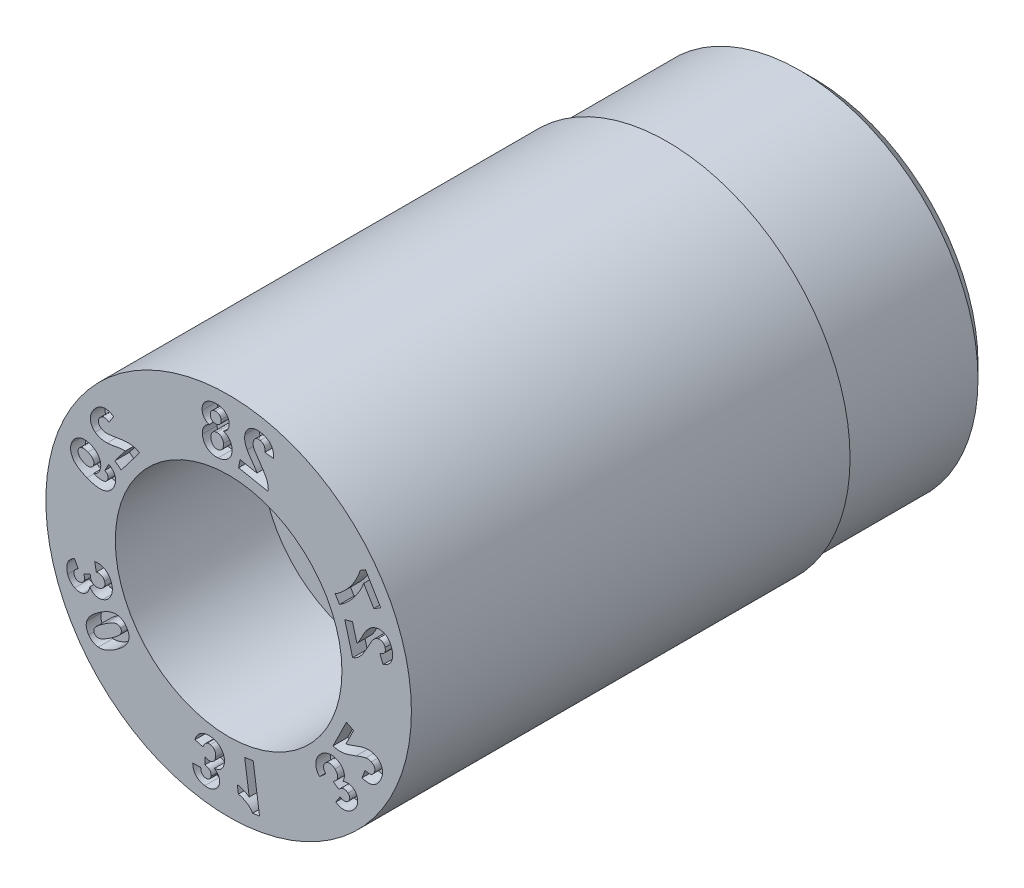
from build123d import *

# Parameters (mm, degrees)
SKETCH4_W          = 2
SKETCH4_H          = 1
CUT_EXTRUDE1_DEPTH = 0.2


with BuildPart() as part:
    # Sketch1 → Revolve1 (revolve)
    with BuildSketch(Plane(origin=(0, 0, 0), x_dir=(0, 0, -1), z_dir=(1, 0, 0)), mode=Mode.PRIVATE) as revolve1_sk:
        Polygon((0, 2.5), (0, 1.55), (2, 1.55), (2, 0.8), (8, 0.8), (8, 2.25), (7.75, 2.5), align=None)
    revolve(revolve1_sk.sketch.rotate(Axis((0, 0, 3.797909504), (0, 0, -1)), 90), axis=Axis((0, 0, 3.797909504), (0, 0, -1)))

    # Sketch4 → Cut-Revolve1 (revolve, cut)
    with BuildSketch(Plane(origin=(0, 0, 0), x_dir=(0, 0, -1), z_dir=(1, 0, 0)), mode=Mode.PRIVATE) as cut_revolve1_sk:
        with Locations((7, 2.935)):
            Rectangle(SKETCH4_W, SKETCH4_H)
    revolve(cut_revolve1_sk.sketch.rotate(Axis((0, 0, 0), (0, 0, -1)), 90), axis=Axis((0, 0, 0), (0, 0, -1)), mode=Mode.SUBTRACT)

    # Sketch6 → Cut-Extrude1 (cut)
    # profile 1 of 12: a face of its own
    with BuildSketch(Plane.XY):
        with BuildLine():
            Line((1.693950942, 0.65999395), (1.588626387, 0.631567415))
            Line((1.588626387, 0.631567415), (1.696082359, 0.234080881))
            add(Edge.make_bspline(
                [(1.696082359, 0.234080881), (1.705576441, 0.238145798), (1.724517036, 0.246255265), (1.751199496, 0.262189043), (1.776044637, 0.281268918), (1.79564423, 0.299575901), (1.810788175, 0.316646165), (1.822859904, 0.331763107), (1.835374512, 0.349202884), (1.848522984, 0.368822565), (1.862282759, 0.390654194), (1.87652278, 0.414800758), (1.891280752, 0.441235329), (1.901114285, 0.459713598), (1.90620458, 0.469278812)],
                knots=[0, 0, 0, 0, 1.150084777, 2.29440738, 3.452176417, 4.636326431, 5.276882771, 5.994082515, 6.791446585, 7.668481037, 8.626072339, 9.667142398, 10.79240413, 12, 12, 12, 12], degree=3))
            add(Edge.make_bspline(
                [(1.90620458, 0.469278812), (1.910213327, 0.476918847), (1.91785425, 0.49148123), (1.929262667, 0.512021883), (1.939579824, 0.53042489), (1.949071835, 0.546545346), (1.957348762, 0.560533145), (1.964942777, 0.572120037), (1.971384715, 0.581650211), (1.975745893, 0.587003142), (1.977684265, 0.589382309)],
                knots=[0, 0, 0, 0, 1.479662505, 2.820329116, 4.029559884, 5.09783273, 6.028857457, 6.816343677, 7.473911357, 8, 8, 8, 8], degree=3))
            add(Edge.make_bspline(
                [(1.977684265, 0.589382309), (1.982436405, 0.594539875), (1.99164, 0.604528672), (2.007316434, 0.616554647), (2.023514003, 0.626023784), (2.035031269, 0.62982165), (2.040714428, 0.631695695)],
                knots=[0, 0, 0, 0, 1.091492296, 2.113922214, 3.069320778, 4, 4, 4, 4], degree=3))
            add(Edge.make_bspline(
                [(2.040714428, 0.631695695), (2.046746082, 0.633098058), (2.058221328, 0.635766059), (2.07526479, 0.636205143), (2.090849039, 0.633542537), (2.104817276, 0.627499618), (2.116964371, 0.618603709), (2.127098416, 0.606898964), (2.135075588, 0.592588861), (2.138483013, 0.581859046), (2.140258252, 0.576268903)],
                knots=[0, 0, 0, 0, 1.147270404, 2.182686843, 3.142211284, 4.059915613, 4.982338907, 5.913874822, 6.913146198, 8, 8, 8, 8], degree=3))
            add(Edge.make_bspline(
                [(2.140258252, 0.576268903), (2.14153206, 0.570541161), (2.143972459, 0.559567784), (2.14399916, 0.54308768), (2.140868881, 0.527714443), (2.135441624, 0.515970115), (2.129704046, 0.507149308), (2.124055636, 0.500976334), (2.117564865, 0.494965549), (2.109923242, 0.489457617), (2.101323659, 0.48418464), (2.091750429, 0.479170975), (2.081074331, 0.474608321), (2.073557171, 0.471885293), (2.069646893, 0.470468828)],
                knots=[0, 0, 0, 0, 1.468341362, 2.813091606, 4.099813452, 5.373393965, 6.032874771, 6.732350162, 7.465620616, 8.248880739, 9.090286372, 9.994697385, 10.956881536, 12, 12, 12, 12], degree=3))
            Line((2.069646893, 0.470468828), (2.111498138, 0.360602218))
            add(Edge.make_bspline(
                [(2.111498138, 0.360602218), (2.118810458, 0.363567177), (2.132963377, 0.369305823), (2.152736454, 0.379529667), (2.170474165, 0.390686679), (2.186253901, 0.402694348), (2.200067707, 0.41559302), (2.211810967, 0.429456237), (2.221410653, 0.444339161), (2.22899259, 0.4600743), (2.234790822, 0.47644599), (2.239175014, 0.493316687), (2.241973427, 0.510682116), (2.243448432, 0.528543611), (2.243236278, 0.54687803), (2.241487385, 0.565684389), (2.238333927, 0.584980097), (2.23514593, 0.59786534), (2.233522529, 0.6044268)],
                knots=[0, 0, 0, 0, 1.240724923, 2.401410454, 3.496188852, 4.533356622, 5.515950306, 6.463496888, 7.383842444, 8.294179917, 9.204727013, 10.111914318, 11.032467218, 11.968258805, 12.927880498, 13.91262994, 14.93706367, 16, 16, 16, 16], degree=3))
            add(Edge.make_bspline(
                [(2.233522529, 0.6044268), (2.231456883, 0.61148499), (2.227425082, 0.625261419), (2.21970935, 0.644856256), (2.211005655, 0.662950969), (2.200989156, 0.679457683), (2.189741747, 0.694331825), (2.177386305, 0.707660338), (2.16388019, 0.719432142), (2.149264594, 0.729429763), (2.134050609, 0.737981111), (2.118286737, 0.744542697), (2.102297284, 0.749551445), (2.085968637, 0.752743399), (2.069382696, 0.754248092), (2.052492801, 0.753744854), (2.035271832, 0.751729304), (2.023865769, 0.748974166), (2.018070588, 0.747574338)],
                knots=[0, 0, 0, 0, 1.214021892, 2.369571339, 3.473396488, 4.526508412, 5.552641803, 6.547855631, 7.522974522, 8.504781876, 9.467453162, 10.400033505, 11.319412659, 12.230158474, 13.142596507, 14.063677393, 15.016194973, 16, 16, 16, 16], degree=3))
            add(Edge.make_bspline(
                [(2.018070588, 0.747574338), (2.01151342, 0.745642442), (1.998507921, 0.741810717), (1.979934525, 0.733721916), (1.962221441, 0.724236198), (1.945475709, 0.712767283), (1.929190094, 0.699564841), (1.913462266, 0.683973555), (1.897575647, 0.666481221), (1.887642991, 0.653584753), (1.882513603, 0.646924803)],
                knots=[0, 0, 0, 0, 0.951532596, 1.887271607, 2.816320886, 3.747087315, 4.710502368, 5.733080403, 6.829325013, 8, 8, 8, 8], degree=3))
            add(Edge.make_bspline(
                [(1.882513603, 0.646924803), (1.880714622, 0.644407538), (1.876880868, 0.63904307), (1.871029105, 0.630299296), (1.864782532, 0.620310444), (1.858093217, 0.609084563), (1.851040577, 0.596559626), (1.843300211, 0.582958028), (1.835303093, 0.568036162), (1.827154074, 0.552320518), (1.818966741, 0.536808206), (1.811364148, 0.522337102), (1.804466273, 0.509349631), (1.798288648, 0.497861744), (1.792751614, 0.4878764), (1.78791426, 0.479425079), (1.783712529, 0.472522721), (1.777379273, 0.462435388), (1.768351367, 0.449555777), (1.759169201, 0.439598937), (1.754789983, 0.434850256)],
                knots=[0, 0, 0, 0, 0.673245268, 1.43473287, 2.288992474, 3.236619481, 4.27804917, 5.416749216, 6.641964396, 7.961668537, 9.268953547, 10.458783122, 11.51875054, 12.46894333, 13.297057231, 14.003249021, 14.587773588, 15.055184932, 16.595539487, 18, 18, 18, 18], degree=3))
            Line((1.754789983, 0.434850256), (1.693950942, 0.65999395))
        make_face()
    # profile 2 of 12: a face of its own
    with BuildSketch(Plane.XY):
        with BuildLine():
            Line((1.986360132, 0.960962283), (2.080380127, 1.017676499))
            Line((2.080380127, 1.017676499), (1.87154872, 1.364381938))
            Line((1.87154872, 1.364381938), (1.798048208, 1.320125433))
            add(Edge.make_bspline(
                [(1.798048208, 1.320125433), (1.796554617, 1.314276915), (1.793487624, 1.302267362), (1.787730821, 1.284022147), (1.780730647, 1.265113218), (1.772683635, 1.245421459), (1.763522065, 1.225007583), (1.753255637, 1.203824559), (1.741930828, 1.181890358), (1.725185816, 1.151793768), (1.702440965, 1.114369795), (1.672036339, 1.071128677), (1.638729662, 1.02981645), (1.608754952, 0.997231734), (1.584006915, 0.972329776), (1.565416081, 0.954859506), (1.547148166, 0.938271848), (1.528848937, 0.923011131), (1.510871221, 0.908549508), (1.492900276, 0.895359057), (1.475100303, 0.883201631), (1.463076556, 0.875824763), (1.457162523, 0.872196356)],
                knots=[0, 0, 0, 0, 0.629869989, 1.293397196, 1.995472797, 2.73363262, 3.513061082, 4.330208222, 5.190044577, 6.088888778, 7.924250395, 9.757566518, 11.601401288, 13.45834079, 14.37541114, 15.264871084, 16.120518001, 16.950111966, 17.751178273, 18.528015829, 19.275985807, 20, 20, 20, 20], degree=3))
            Line((1.457162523, 0.872196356), (1.516121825, 0.774456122))
            add(Edge.make_bspline(
                [(1.516121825, 0.774456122), (1.525099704, 0.780326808), (1.543082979, 0.792086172), (1.569140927, 0.811346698), (1.594637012, 0.831806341), (1.619433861, 0.853734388), (1.643706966, 0.876920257), (1.667349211, 0.901433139), (1.690393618, 0.927285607), (1.712480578, 0.954446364), (1.733962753, 0.982260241), (1.753941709, 1.010899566), (1.772866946, 1.03981865), (1.790420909, 1.06924871), (1.806706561, 1.099117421), (1.821592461, 1.12948247), (1.835492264, 1.160125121), (1.843497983, 1.181015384), (1.847493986, 1.191442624)],
                knots=[0, 0, 0, 0, 0.950802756, 1.904519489, 2.871247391, 3.848073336, 4.838076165, 5.84635357, 6.866478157, 7.907282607, 8.949309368, 9.981314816, 11.002086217, 12.012692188, 13.018381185, 14.017101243, 15.010248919, 16, 16, 16, 16], degree=3))
            Line((1.847493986, 1.191442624), (1.986360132, 0.960962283))
        make_face()
    # profile 3 of 12: a face of its own
    with BuildSketch(Plane.XY):
        with BuildLine():
            Line((0.157476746, 1.811937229), (0.136252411, 1.704527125))
            Line((0.136252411, 1.704527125), (0.541370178, 1.624316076))
            add(Edge.make_bspline(
                [(0.541370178, 1.624316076), (0.541970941, 1.634646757), (0.543171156, 1.655285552), (0.540332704, 1.686317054), (0.534607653, 1.717207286), (0.526709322, 1.742924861), (0.518153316, 1.764132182), (0.510039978, 1.781748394), (0.499875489, 1.800731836), (0.488019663, 1.821255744), (0.474470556, 1.843331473), (0.459182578, 1.866949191), (0.441893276, 1.891928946), (0.429657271, 1.909001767), (0.423327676, 1.917833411)],
                knots=[0, 0, 0, 0, 1.148368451, 2.294228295, 3.451452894, 4.634714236, 5.275557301, 5.991609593, 6.788471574, 7.667164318, 8.624930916, 9.666149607, 10.792716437, 12, 12, 12, 12], degree=3))
            add(Edge.make_bspline(
                [(0.423327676, 1.917833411), (0.418273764, 1.92485282), (0.408616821, 1.938265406), (0.395114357, 1.957594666), (0.383213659, 1.975122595), (0.372831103, 1.990726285), (0.364095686, 2.004533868), (0.356898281, 2.016430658), (0.351211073, 2.026495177), (0.348321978, 2.032769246), (0.347034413, 2.035565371)],
                knots=[0, 0, 0, 0, 1.477945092, 2.824036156, 4.028698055, 5.098021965, 6.026444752, 6.820154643, 7.474185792, 8, 8, 8, 8], degree=3))
            add(Edge.make_bspline(
                [(0.347034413, 2.035565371), (0.344552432, 2.042132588), (0.339757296, 2.054820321), (0.33582838, 2.074171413), (0.334655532, 2.092898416), (0.336383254, 2.10492088), (0.337236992, 2.110861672)],
                knots=[0, 0, 0, 0, 1.09271195, 2.111097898, 3.066616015, 4, 4, 4, 4], degree=3))
            add(Edge.make_bspline(
                [(0.337236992, 2.110861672), (0.338685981, 2.116914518), (0.341439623, 2.128417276), (0.348544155, 2.143979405), (0.357944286, 2.156759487), (0.369506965, 2.166667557), (0.382918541, 2.173580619), (0.397881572, 2.177604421), (0.414333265, 2.178241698), (0.425494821, 2.176534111), (0.431321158, 2.17564275)],
                knots=[0, 0, 0, 0, 1.15006033, 2.18556128, 3.142707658, 4.064604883, 4.978055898, 5.91295048, 6.910559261, 8, 8, 8, 8], degree=3))
            add(Edge.make_bspline(
                [(0.431321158, 2.17564275), (0.437007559, 2.174273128), (0.447952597, 2.171636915), (0.462708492, 2.164298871), (0.475215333, 2.154749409), (0.483489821, 2.144672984), (0.488571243, 2.1354272), (0.491833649, 2.127716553), (0.494175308, 2.119166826), (0.495907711, 2.109865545), (0.496650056, 2.099768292), (0.496982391, 2.088898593), (0.496268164, 2.077249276), (0.49534942, 2.06926041), (0.494876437, 2.065147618)],
                knots=[0, 0, 0, 0, 1.459090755, 2.808420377, 4.087128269, 5.370523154, 6.033545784, 6.721800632, 7.459239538, 8.246262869, 9.084479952, 9.988662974, 10.964532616, 12, 12, 12, 12], degree=3))
            Line((0.494876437, 2.065147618), (0.612358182, 2.053753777))
            add(Edge.make_bspline(
                [(0.612358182, 2.053753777), (0.612887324, 2.061634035), (0.613914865, 2.076936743), (0.61351589, 2.099274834), (0.611544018, 2.120225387), (0.607746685, 2.139778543), (0.602041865, 2.157856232), (0.594955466, 2.174660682), (0.585960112, 2.190009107), (0.575145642, 2.203808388), (0.562946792, 2.21627516), (0.549776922, 2.227787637), (0.535427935, 2.238075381), (0.520006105, 2.24723174), (0.503468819, 2.255199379), (0.485796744, 2.262005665), (0.467042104, 2.267690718), (0.454065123, 2.270534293), (0.447468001, 2.271979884)],
                knots=[0, 0, 0, 0, 1.238138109, 2.404346, 3.499268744, 4.53465455, 5.521366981, 6.467116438, 7.389056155, 8.302244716, 9.209319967, 10.120891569, 11.042099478, 11.974043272, 12.930209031, 13.917241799, 14.941185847, 16, 16, 16, 16], degree=3))
            add(Edge.make_bspline(
                [(0.447468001, 2.271979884), (0.440192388, 2.273303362), (0.42599571, 2.275885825), (0.404943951, 2.277613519), (0.384804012, 2.277656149), (0.36554971, 2.276049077), (0.347166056, 2.272668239), (0.329648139, 2.26764473), (0.313139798, 2.260549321), (0.297554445, 2.251973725), (0.283185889, 2.241935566), (0.270081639, 2.230906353), (0.258607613, 2.218642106), (0.248449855, 2.205464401), (0.239763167, 2.191156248), (0.232516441, 2.175815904), (0.226877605, 2.159370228), (0.224271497, 2.147951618), (0.222948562, 2.142155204)],
                knots=[0, 0, 0, 0, 1.217302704, 2.375285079, 3.473028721, 4.531161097, 5.552451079, 6.546990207, 7.525697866, 8.505331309, 9.471730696, 10.40790542, 11.320850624, 12.232190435, 13.14350474, 14.072000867, 15.021292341, 16, 16, 16, 16], degree=3))
            add(Edge.make_bspline(
                [(0.222948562, 2.142155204), (0.221771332, 2.135392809), (0.219443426, 2.122020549), (0.21845782, 2.101715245), (0.219078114, 2.081571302), (0.22194419, 2.061395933), (0.22648992, 2.040866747), (0.233574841, 2.019799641), (0.242066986, 1.997629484), (0.249346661, 1.982982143), (0.253105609, 1.975418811)],
                knots=[0, 0, 0, 0, 0.952031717, 1.882589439, 2.81624764, 3.745793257, 4.707197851, 5.730766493, 6.828253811, 8, 8, 8, 8], degree=3))
            add(Edge.make_bspline(
                [(0.253105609, 1.975418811), (0.25454656, 1.972654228), (0.257599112, 1.966797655), (0.26306203, 1.957745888), (0.269092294, 1.947610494), (0.276274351, 1.936602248), (0.284259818, 1.924631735), (0.293383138, 1.911799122), (0.303085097, 1.897853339), (0.313625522, 1.883514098), (0.324042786, 1.869369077), (0.333562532, 1.855993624), (0.342259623, 1.844053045), (0.349742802, 1.833295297), (0.356312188, 1.82394522), (0.361653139, 1.815775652), (0.366188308, 1.809036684), (0.372337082, 1.798817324), (0.379834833, 1.785061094), (0.384726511, 1.772502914), (0.387055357, 1.766524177)],
                knots=[0, 0, 0, 0, 0.676649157, 1.433432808, 2.294471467, 3.236938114, 4.28638453, 5.418264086, 6.654914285, 7.974423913, 9.28157065, 10.468627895, 11.538504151, 12.488398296, 13.313555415, 14.019018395, 14.607352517, 15.076524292, 16.608182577, 18, 18, 18, 18], degree=3))
            Line((0.387055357, 1.766524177), (0.157476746, 1.811937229))
        make_face()
    # profile 4 of 12: a face of its own
    with BuildSketch(Plane.XY):
        with BuildLine():
            add(Edge.make_bspline(
                [(-0.069693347, 2.032463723), (-0.062735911, 2.036351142), (-0.049375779, 2.043816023), (-0.032077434, 2.057910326), (-0.017925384, 2.073416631), (-0.007218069, 2.090567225), (0.000464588, 2.108724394), (0.005337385, 2.127568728), (0.007830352, 2.146994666), (0.007236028, 2.16005021), (0.006934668, 2.16667018)],
                knots=[0, 0, 0, 0, 1.159679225, 2.226893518, 3.236109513, 4.206184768, 5.15855384, 6.098339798, 7.035740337, 8, 8, 8, 8], degree=3))
            add(Edge.make_bspline(
                [(0.006934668, 2.16667018), (0.006306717, 2.17227253), (0.005073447, 2.183275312), (0.001477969, 2.19925781), (-0.003563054, 2.214373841), (-0.010164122, 2.228569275), (-0.018067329, 2.241903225), (-0.027443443, 2.254334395), (-0.038250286, 2.265897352), (-0.050466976, 2.276546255), (-0.064016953, 2.285940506), (-0.078719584, 2.294041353), (-0.094612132, 2.300552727), (-0.111665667, 2.305507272), (-0.129847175, 2.308833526), (-0.149166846, 2.310720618), (-0.169623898, 2.31121936), (-0.183595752, 2.310284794), (-0.190751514, 2.309806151)],
                knots=[0, 0, 0, 0, 0.983089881, 1.930747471, 2.852331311, 3.758325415, 4.657120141, 5.552074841, 6.469686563, 7.414034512, 8.374382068, 9.341228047, 10.337420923, 11.364816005, 12.434366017, 13.557672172, 14.749148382, 16, 16, 16, 16], degree=3))
            add(Edge.make_bspline(
                [(-0.190751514, 2.309806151), (-0.197852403, 2.30911129), (-0.211675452, 2.307758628), (-0.231590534, 2.303767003), (-0.250251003, 2.29888413), (-0.26749603, 2.292411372), (-0.283427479, 2.284718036), (-0.298014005, 2.275651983), (-0.311326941, 2.265387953), (-0.32313288, 2.253767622), (-0.333382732, 2.241196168), (-0.342428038, 2.228085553), (-0.349639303, 2.214214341), (-0.355371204, 2.19975287), (-0.359520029, 2.184657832), (-0.362017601, 2.168902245), (-0.362985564, 2.1525354), (-0.362295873, 2.141482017), (-0.361944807, 2.135855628)],
                knots=[0, 0, 0, 0, 1.245069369, 2.423732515, 3.542249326, 4.609801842, 5.634571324, 6.62661576, 7.603371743, 8.563943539, 9.511920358, 10.432234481, 11.340200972, 12.235299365, 13.144100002, 14.067644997, 15.016393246, 16, 16, 16, 16], degree=3))
            add(Edge.make_bspline(
                [(-0.361944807, 2.135855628), (-0.361112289, 2.128939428), (-0.359475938, 2.115345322), (-0.353597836, 2.095836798), (-0.344922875, 2.077787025), (-0.333709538, 2.061281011), (-0.320079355, 2.046615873), (-0.304299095, 2.034002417), (-0.286438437, 2.02347961), (-0.273350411, 2.01853385), (-0.266678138, 2.016012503)],
                knots=[0, 0, 0, 0, 1.027172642, 2.018954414, 2.99217453, 3.97418668, 4.954198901, 5.937047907, 6.948307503, 8, 8, 8, 8], degree=3))
            add(Edge.make_bspline(
                [(-0.266678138, 2.016012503), (-0.270720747, 2.013934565), (-0.278643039, 2.009862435), (-0.289711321, 2.002709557), (-0.300060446, 1.995182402), (-0.309665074, 1.987199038), (-0.31839456, 1.978590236), (-0.326289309, 1.969465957), (-0.333380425, 1.959806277), (-0.339645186, 1.949660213), (-0.344968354, 1.93905795), (-0.349656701, 1.928193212), (-0.353241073, 1.916954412), (-0.356182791, 1.905478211), (-0.358043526, 1.893631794), (-0.359171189, 1.881504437), (-0.359346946, 1.869045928), (-0.358820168, 1.860683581), (-0.358552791, 1.856439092)],
                knots=[0, 0, 0, 0, 1.109304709, 2.173901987, 3.213732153, 4.233215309, 5.220409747, 6.204130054, 7.176408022, 8.143574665, 9.112061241, 10.0711636, 11.029786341, 11.989527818, 12.961385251, 13.954462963, 14.961743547, 16, 16, 16, 16], degree=3))
            add(Edge.make_bspline(
                [(-0.358552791, 1.856439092), (-0.357801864, 1.849515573), (-0.356331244, 1.835956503), (-0.35214444, 1.81627945), (-0.346193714, 1.797826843), (-0.338943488, 1.780328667), (-0.329701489, 1.764171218), (-0.31905268, 1.74899492), (-0.3066863, 1.735065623), (-0.292859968, 1.722324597), (-0.277731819, 1.7109876), (-0.26147488, 1.701397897), (-0.244267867, 1.69345593), (-0.226039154, 1.68746145), (-0.206824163, 1.683285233), (-0.186639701, 1.680731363), (-0.165471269, 1.68003554), (-0.151091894, 1.68087189), (-0.143758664, 1.681298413)],
                knots=[0, 0, 0, 0, 1.070968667, 2.097392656, 3.088221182, 4.050679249, 5.005690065, 5.945780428, 6.898409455, 7.865388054, 8.833959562, 9.801168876, 10.763964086, 11.744089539, 12.747065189, 13.784789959, 14.870281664, 16, 16, 16, 16], degree=3))
            add(Edge.make_bspline(
                [(-0.143758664, 1.681298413), (-0.136914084, 1.682019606), (-0.123519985, 1.683430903), (-0.103970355, 1.68711522), (-0.085430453, 1.692089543), (-0.067868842, 1.698443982), (-0.051367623, 1.70618218), (-0.035795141, 1.715061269), (-0.021277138, 1.725372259), (-0.01239225, 1.733159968), (-0.00793725, 1.737064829)],
                knots=[0, 0, 0, 0, 1.103425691, 2.159284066, 3.186596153, 4.17891993, 5.150231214, 6.106056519, 7.050351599, 8, 8, 8, 8], degree=3))
            add(Edge.make_bspline(
                [(-0.00793725, 1.737064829), (-0.003070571, 1.741914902), (0.006531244, 1.751483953), (0.01872766, 1.767530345), (0.028882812, 1.784570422), (0.036610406, 1.802763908), (0.042481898, 1.821904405), (0.045915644, 1.842095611), (0.047387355, 1.863315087), (0.046525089, 1.877710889), (0.04608288, 1.885093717)],
                knots=[0, 0, 0, 0, 1.007971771, 1.988698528, 2.950801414, 3.913672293, 4.884284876, 5.8841574, 6.914898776, 8, 8, 8, 8], degree=3))
            add(Edge.make_bspline(
                [(0.04608288, 1.885093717), (0.045113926, 1.893247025), (0.043199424, 1.909356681), (0.036339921, 1.932580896), (0.026666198, 1.954474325), (0.016314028, 1.971620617), (0.006326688, 1.98428195), (-0.001971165, 1.993230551), (-0.011158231, 2.001506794), (-0.021210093, 2.0090718), (-0.032139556, 2.015938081), (-0.043826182, 2.022195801), (-0.056381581, 2.027799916), (-0.065194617, 2.030887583), (-0.069693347, 2.032463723)],
                knots=[0, 0, 0, 0, 1.479301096, 2.92286648, 4.348658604, 5.789844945, 6.521913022, 7.25531369, 7.989094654, 8.749977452, 9.522287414, 10.315658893, 11.14020615, 12, 12, 12, 12], degree=3))
        make_face()
        with BuildLine():
            add(Edge.make_bspline(
                [(-0.103944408, 2.148988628), (-0.103680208, 2.143408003), (-0.103175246, 2.132741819), (-0.105717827, 2.117403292), (-0.110902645, 2.103768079), (-0.118817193, 2.092090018), (-0.128939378, 2.082413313), (-0.141173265, 2.075220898), (-0.15522507, 2.070218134), (-0.165309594, 2.068996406), (-0.170584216, 2.068357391)],
                knots=[0, 0, 0, 0, 1.13060341, 2.160909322, 3.128614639, 4.067024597, 4.998572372, 5.945061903, 6.92518279, 8, 8, 8, 8], degree=3))
            add(Edge.make_bspline(
                [(-0.170584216, 2.068357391), (-0.175916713, 2.068162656), (-0.186201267, 2.067787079), (-0.201098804, 2.070131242), (-0.214395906, 2.075593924), (-0.226191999, 2.08335846), (-0.236106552, 2.09365929), (-0.243550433, 2.10632867), (-0.24857466, 2.121080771), (-0.249894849, 2.131686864), (-0.250586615, 2.137244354)],
                knots=[0, 0, 0, 0, 1.071950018, 2.067422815, 3.005770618, 3.942491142, 4.889482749, 5.854464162, 6.875760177, 8, 8, 8, 8], degree=3))
            add(Edge.make_bspline(
                [(-0.250586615, 2.137244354), (-0.250851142, 2.142534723), (-0.251360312, 2.152717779), (-0.248643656, 2.167371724), (-0.243441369, 2.18063067), (-0.235470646, 2.192179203), (-0.225351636, 2.2018596), (-0.213294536, 2.209343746), (-0.199330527, 2.214217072), (-0.189335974, 2.215442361), (-0.184147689, 2.216078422)],
                knots=[0, 0, 0, 0, 1.090854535, 2.099708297, 3.051432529, 4.012939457, 4.973419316, 5.92452879, 6.922599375, 8, 8, 8, 8], degree=3))
            add(Edge.make_bspline(
                [(-0.184147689, 2.216078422), (-0.178732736, 2.216296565), (-0.168365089, 2.216714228), (-0.153303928, 2.214310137), (-0.139867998, 2.208862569), (-0.128031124, 2.200951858), (-0.118364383, 2.190646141), (-0.110869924, 2.178428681), (-0.105800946, 2.164351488), (-0.104576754, 2.154221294), (-0.103944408, 2.148988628)],
                knots=[0, 0, 0, 0, 1.101179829, 2.108354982, 3.076502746, 4.030022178, 4.983429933, 5.928424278, 6.929945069, 8, 8, 8, 8], degree=3))
        make_face(mode=Mode.SUBTRACT)
        with BuildLine():
            add(Edge.make_bspline(
                [(-0.071059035, 1.886634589), (-0.070788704, 1.882682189), (-0.070262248, 1.874985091), (-0.070585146, 1.863713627), (-0.071443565, 1.853021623), (-0.073475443, 1.842985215), (-0.076162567, 1.833490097), (-0.079644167, 1.824570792), (-0.084157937, 1.816306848), (-0.089358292, 1.808666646), (-0.095260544, 1.801738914), (-0.101680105, 1.795635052), (-0.108475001, 1.790215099), (-0.115892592, 1.785913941), (-0.123591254, 1.782080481), (-0.131880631, 1.779438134), (-0.140521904, 1.777207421), (-0.146513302, 1.776602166), (-0.149568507, 1.776293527)],
                knots=[0, 0, 0, 0, 1.247773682, 2.429975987, 3.550296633, 4.623827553, 5.650923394, 6.657849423, 7.633957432, 8.612068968, 9.565949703, 10.495975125, 11.400858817, 12.297331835, 13.193424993, 14.105056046, 15.033707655, 16, 16, 16, 16], degree=3))
            add(Edge.make_bspline(
                [(-0.149568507, 1.776293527), (-0.152569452, 1.776094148), (-0.158459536, 1.775702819), (-0.167153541, 1.776342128), (-0.175526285, 1.777633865), (-0.183486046, 1.780069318), (-0.19125747, 1.782969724), (-0.198588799, 1.786975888), (-0.205652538, 1.791725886), (-0.212196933, 1.797471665), (-0.218530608, 1.803777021), (-0.224012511, 1.811099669), (-0.228799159, 1.81921533), (-0.232905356, 1.828107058), (-0.236442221, 1.837741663), (-0.23917499, 1.848157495), (-0.241166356, 1.859358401), (-0.241966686, 1.86710771), (-0.242379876, 1.871108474)],
                knots=[0, 0, 0, 0, 0.964048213, 1.892179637, 2.791329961, 3.676730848, 4.558535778, 5.448807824, 6.350898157, 7.284812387, 8.239384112, 9.213994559, 10.210810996, 11.258397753, 12.352874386, 13.500417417, 14.70953122, 16, 16, 16, 16], degree=3))
            add(Edge.make_bspline(
                [(-0.242379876, 1.871108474), (-0.242619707, 1.874645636), (-0.243085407, 1.881514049), (-0.242719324, 1.891640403), (-0.241594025, 1.901318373), (-0.239641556, 1.910540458), (-0.236949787, 1.919291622), (-0.233361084, 1.927516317), (-0.229003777, 1.935281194), (-0.22396287, 1.942609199), (-0.218121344, 1.949149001), (-0.21201127, 1.955222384), (-0.205172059, 1.960243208), (-0.198005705, 1.964632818), (-0.190330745, 1.968217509), (-0.182178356, 1.970960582), (-0.173521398, 1.972952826), (-0.167540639, 1.973589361), (-0.164489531, 1.973914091)],
                knots=[0, 0, 0, 0, 1.175091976, 2.281778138, 3.354910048, 4.402800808, 5.403673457, 6.386202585, 7.372561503, 8.353170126, 9.328864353, 10.277123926, 11.204376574, 12.134977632, 13.061009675, 14.006781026, 14.983151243, 16, 16, 16, 16], degree=3))
            add(Edge.make_bspline(
                [(-0.164489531, 1.973914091), (-0.160986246, 1.974111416), (-0.154172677, 1.974495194), (-0.144219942, 1.973923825), (-0.134915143, 1.972241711), (-0.126082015, 1.969970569), (-0.118034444, 1.966139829), (-0.110487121, 1.961609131), (-0.103583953, 1.956024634), (-0.095369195, 1.947380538), (-0.086795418, 1.935392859), (-0.078773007, 1.919957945), (-0.0732134, 1.903658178), (-0.071777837, 1.892314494), (-0.071059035, 1.886634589)],
                knots=[0, 0, 0, 0, 0.880092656, 1.711699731, 2.493678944, 3.251192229, 3.991703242, 4.720757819, 5.456663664, 6.211608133, 7.707602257, 9.136742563, 10.566335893, 12, 12, 12, 12], degree=3))
        make_face(mode=Mode.SUBTRACT)
    # profile 5 of 12: a face of its own
    with BuildSketch(Plane.XY):
        with BuildLine():
            Line((-1.556225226, 0.940884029), (-1.469122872, 0.874364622))
            Line((-1.469122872, 0.874364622), (-1.217944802, 1.203271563))
            add(Edge.make_bspline(
                [(-1.217944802, 1.203271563), (-1.22697459, 1.208387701), (-1.245019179, 1.218611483), (-1.274144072, 1.229935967), (-1.304539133, 1.238264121), (-1.331129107, 1.242565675), (-1.353980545, 1.244444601), (-1.373422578, 1.244490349), (-1.39499257, 1.24412975), (-1.418705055, 1.242410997), (-1.444530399, 1.240105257), (-1.472461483, 1.23643702), (-1.502605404, 1.232380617), (-1.523352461, 1.228835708), (-1.534101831, 1.226999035)],
                knots=[0, 0, 0, 0, 1.149354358, 2.296800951, 3.453144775, 4.638287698, 5.277076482, 5.993274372, 6.792543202, 7.668374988, 8.628200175, 9.666750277, 10.791107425, 12, 12, 12, 12], degree=3))
            add(Edge.make_bspline(
                [(-1.534101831, 1.226999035), (-1.542676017, 1.225548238), (-1.559012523, 1.222784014), (-1.582344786, 1.219105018), (-1.603327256, 1.216166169), (-1.621911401, 1.213531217), (-1.638217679, 1.21190049), (-1.652140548, 1.210540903), (-1.663729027, 1.210058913), (-1.670648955, 1.21017978), (-1.673702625, 1.210233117)],
                knots=[0, 0, 0, 0, 1.482543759, 2.824709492, 4.026680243, 5.094745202, 6.024175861, 6.820226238, 7.479381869, 8, 8, 8, 8], degree=3))
            add(Edge.make_bspline(
                [(-1.673702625, 1.210233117), (-1.680710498, 1.21094123), (-1.694220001, 1.212306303), (-1.713470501, 1.217247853), (-1.730888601, 1.224514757), (-1.740984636, 1.23145636), (-1.74592254, 1.234851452)],
                knots=[0, 0, 0, 0, 1.091248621, 2.103666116, 3.072515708, 4, 4, 4, 4], degree=3))
            add(Edge.make_bspline(
                [(-1.74592254, 1.234851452), (-1.750711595, 1.238792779), (-1.759833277, 1.2462998), (-1.770538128, 1.259602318), (-1.777958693, 1.273660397), (-1.781658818, 1.288447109), (-1.782189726, 1.303579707), (-1.778901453, 1.318704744), (-1.772557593, 1.333900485), (-1.765999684, 1.343129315), (-1.762558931, 1.347971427)],
                knots=[0, 0, 0, 0, 1.144860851, 2.180609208, 3.135884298, 4.062646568, 4.976504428, 5.911488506, 6.90421587, 8, 8, 8, 8], degree=3))
            add(Edge.make_bspline(
                [(-1.762558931, 1.347971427), (-1.758802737, 1.352495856), (-1.751576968, 1.361199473), (-1.738482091, 1.371364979), (-1.724217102, 1.378132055), (-1.711581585, 1.3812139), (-1.701015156, 1.381838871), (-1.69264251, 1.381276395), (-1.683877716, 1.379592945), (-1.674787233, 1.376857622), (-1.665314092, 1.373267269), (-1.655463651, 1.368613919), (-1.645241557, 1.362969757), (-1.638450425, 1.358581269), (-1.634955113, 1.356322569)],
                knots=[0, 0, 0, 0, 1.463013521, 2.81439029, 4.093969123, 5.374546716, 6.028419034, 6.726958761, 7.460973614, 8.248756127, 9.091111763, 9.984535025, 10.962664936, 12, 12, 12, 12], degree=3))
            Line((-1.634955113, 1.356322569), (-1.573026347, 1.456977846))
            add(Edge.make_bspline(
                [(-1.573026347, 1.456977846), (-1.579855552, 1.46096559), (-1.593105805, 1.468702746), (-1.613429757, 1.478109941), (-1.633147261, 1.485604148), (-1.652434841, 1.490691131), (-1.67113307, 1.493869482), (-1.689388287, 1.494745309), (-1.707152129, 1.493455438), (-1.724328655, 1.489844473), (-1.740967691, 1.484568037), (-1.756963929, 1.477492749), (-1.772666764, 1.469324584), (-1.787648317, 1.459353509), (-1.802260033, 1.448028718), (-1.816094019, 1.435037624), (-1.829695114, 1.420785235), (-1.837946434, 1.410309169), (-1.842171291, 1.404945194)],
                knots=[0, 0, 0, 0, 1.236541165, 2.399178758, 3.499154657, 4.532250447, 5.514754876, 6.461005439, 7.384439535, 8.293036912, 9.200594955, 10.110115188, 11.026160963, 11.966251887, 12.921305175, 13.91493233, 14.932399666, 16, 16, 16, 16], degree=3))
            add(Edge.make_bspline(
                [(-1.842171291, 1.404945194), (-1.846557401, 1.399000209), (-1.855135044, 1.387373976), (-1.865965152, 1.369195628), (-1.874957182, 1.351119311), (-1.881954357, 1.333066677), (-1.887028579, 1.315072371), (-1.890084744, 1.297069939), (-1.891111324, 1.279125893), (-1.890271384, 1.261316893), (-1.887567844, 1.244016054), (-1.883367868, 1.227388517), (-1.877441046, 1.211641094), (-1.870296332, 1.196548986), (-1.86098291, 1.182605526), (-1.85044053, 1.169323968), (-1.838303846, 1.15683298), (-1.829152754, 1.149479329), (-1.824512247, 1.145750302)],
                knots=[0, 0, 0, 0, 1.214440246, 2.375004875, 3.474797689, 4.531574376, 5.554489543, 6.544586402, 7.528577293, 8.504905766, 9.471115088, 10.404027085, 11.320064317, 12.234810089, 13.143479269, 14.070608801, 15.021608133, 16, 16, 16, 16], degree=3))
            add(Edge.make_bspline(
                [(-1.824512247, 1.145750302), (-1.818926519, 1.141735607), (-1.807846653, 1.133772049), (-1.790088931, 1.123741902), (-1.771571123, 1.11562253), (-1.75223272, 1.109179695), (-1.731706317, 1.104325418), (-1.70968162, 1.101209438), (-1.686011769, 1.099114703), (-1.669680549, 1.099168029), (-1.661237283, 1.099195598)],
                knots=[0, 0, 0, 0, 0.952680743, 1.889739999, 2.819730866, 3.750517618, 4.710613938, 5.738117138, 6.830603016, 8, 8, 8, 8], degree=3))
            add(Edge.make_bspline(
                [(-1.661237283, 1.099195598), (-1.658135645, 1.099293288), (-1.651487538, 1.099502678), (-1.640909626, 1.100211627), (-1.629077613, 1.101419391), (-1.616012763, 1.10288584), (-1.601702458, 1.104908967), (-1.586151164, 1.107170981), (-1.569359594, 1.10999515), (-1.551813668, 1.11299367), (-1.534470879, 1.116174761), (-1.518262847, 1.118858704), (-1.503694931, 1.121336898), (-1.490760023, 1.123284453), (-1.479457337, 1.124958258), (-1.469781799, 1.126286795), (-1.461740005, 1.127400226), (-1.449806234, 1.12845523), (-1.434013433, 1.128966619), (-1.42044789, 1.127717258), (-1.41397638, 1.127121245)],
                knots=[0, 0, 0, 0, 0.671719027, 1.439774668, 2.294303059, 3.246157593, 4.285498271, 5.422662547, 6.647912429, 7.971262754, 9.27594048, 10.464625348, 11.527575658, 12.474693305, 13.296156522, 14.000900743, 14.588977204, 15.053092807, 16.594163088, 18, 18, 18, 18], degree=3))
            Line((-1.41397638, 1.127121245), (-1.556225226, 0.940884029))
        make_face()
    # profile 6 of 12: a face of its own
    with BuildSketch(Plane.XY):
        with BuildLine():
            Line((-1.6394161, 0.858106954), (-1.692631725, 0.757147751))
            add(Edge.make_bspline(
                [(-1.692631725, 0.757147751), (-1.687874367, 0.754399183), (-1.678875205, 0.749199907), (-1.667327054, 0.739807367), (-1.658589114, 0.72952575), (-1.652467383, 0.718523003), (-1.648930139, 0.706795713), (-1.648314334, 0.694499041), (-1.649696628, 0.681638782), (-1.652663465, 0.673324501), (-1.654211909, 0.668985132)],
                knots=[0, 0, 0, 0, 1.228832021, 2.324495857, 3.314370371, 4.231813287, 5.125201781, 6.030056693, 6.971851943, 8, 8, 8, 8], degree=3))
            add(Edge.make_bspline(
                [(-1.654211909, 0.668985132), (-1.655401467, 0.666273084), (-1.657762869, 0.660889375), (-1.662351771, 0.653417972), (-1.667797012, 0.646629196), (-1.674110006, 0.640583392), (-1.68131609, 0.635279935), (-1.689339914, 0.63066457), (-1.698267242, 0.626908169), (-1.708028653, 0.623461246), (-1.719305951, 0.621351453), (-1.732274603, 0.620494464), (-1.747138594, 0.621159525), (-1.763859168, 0.623013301), (-1.782392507, 0.626451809), (-1.802805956, 0.630965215), (-1.825058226, 0.637006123), (-1.84045285, 0.641690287), (-1.848494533, 0.644137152)],
                knots=[0, 0, 0, 0, 0.656028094, 1.302286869, 1.937300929, 2.580881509, 3.23440039, 3.916681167, 4.627804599, 5.379421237, 6.207469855, 7.162133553, 8.255325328, 9.501850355, 10.889464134, 12.43225202, 14.136316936, 16, 16, 16, 16], degree=3))
            add(Edge.make_bspline(
                [(-1.848494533, 0.644137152), (-1.843345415, 0.646132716), (-1.833237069, 0.650050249), (-1.818971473, 0.65742724), (-1.806063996, 0.666212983), (-1.794370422, 0.676158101), (-1.78399946, 0.687387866), (-1.77467884, 0.699722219), (-1.766693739, 0.713417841), (-1.762517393, 0.723258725), (-1.760398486, 0.728251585)],
                knots=[0, 0, 0, 0, 1.052494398, 2.066174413, 3.054266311, 4.02364, 4.986693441, 5.963048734, 6.966534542, 8, 8, 8, 8], degree=3))
            add(Edge.make_bspline(
                [(-1.760398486, 0.728251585), (-1.758396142, 0.733818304), (-1.754445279, 0.744802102), (-1.750734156, 0.761793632), (-1.748600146, 0.778815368), (-1.748598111, 0.795914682), (-1.75021745, 0.813066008), (-1.753921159, 0.830266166), (-1.759404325, 0.847531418), (-1.766563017, 0.86469039), (-1.775468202, 0.881296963), (-1.786080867, 0.896904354), (-1.798160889, 0.911461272), (-1.811969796, 0.924728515), (-1.827306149, 0.936928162), (-1.844179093, 0.948038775), (-1.862693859, 0.957888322), (-1.875808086, 0.963396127), (-1.882522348, 0.96621603)],
                knots=[0, 0, 0, 0, 0.950865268, 1.876170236, 2.791400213, 3.705854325, 4.621278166, 5.558160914, 6.530524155, 7.532103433, 8.545220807, 9.556650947, 10.563707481, 11.582958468, 12.631705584, 13.71245105, 14.828813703, 16, 16, 16, 16], degree=3))
            add(Edge.make_bspline(
                [(-1.882522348, 0.96621603), (-1.889602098, 0.968836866), (-1.903477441, 0.973973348), (-1.924603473, 0.979431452), (-1.945308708, 0.982940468), (-1.965610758, 0.984494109), (-1.985461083, 0.983812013), (-2.004911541, 0.981334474), (-2.023938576, 0.976618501), (-2.042373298, 0.969988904), (-2.060042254, 0.961699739), (-2.076353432, 0.951504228), (-2.091595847, 0.940092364), (-2.105263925, 0.926860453), (-2.117868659, 0.91237012), (-2.128883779, 0.896110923), (-2.138794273, 0.878477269), (-2.144093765, 0.865829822), (-2.146787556, 0.859400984)],
                knots=[0, 0, 0, 0, 1.130941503, 2.216490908, 3.264594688, 4.275351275, 5.262596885, 6.236649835, 7.209041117, 8.194276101, 9.169099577, 10.128033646, 11.072687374, 12.017524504, 12.973845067, 13.946176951, 14.956018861, 16, 16, 16, 16], degree=3))
            add(Edge.make_bspline(
                [(-2.146787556, 0.859400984), (-2.149342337, 0.852242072), (-2.154361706, 0.83817698), (-2.159228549, 0.816604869), (-2.161561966, 0.79517673), (-2.161462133, 0.773879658), (-2.158673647, 0.752762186), (-2.153638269, 0.73178132), (-2.145867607, 0.711046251), (-2.135868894, 0.690353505), (-2.122714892, 0.670101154), (-2.106167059, 0.650600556), (-2.086325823, 0.631723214), (-2.063080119, 0.613626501), (-2.03640307, 0.59632812), (-2.006438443, 0.579580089), (-1.973093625, 0.563495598), (-1.949405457, 0.553837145), (-1.937153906, 0.54884178)],
                knots=[0, 0, 0, 0, 0.861188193, 1.691973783, 2.500218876, 3.300410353, 4.100285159, 4.91000078, 5.741237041, 6.605935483, 7.51094213, 8.470947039, 9.498948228, 10.610615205, 11.805878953, 13.100240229, 14.500240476, 16, 16, 16, 16], degree=3))
            add(Edge.make_bspline(
                [(-1.937153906, 0.54884178), (-1.924524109, 0.544106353), (-1.900138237, 0.534963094), (-1.864109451, 0.523748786), (-1.830001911, 0.515667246), (-1.797922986, 0.510089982), (-1.767799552, 0.507734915), (-1.739655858, 0.50802794), (-1.713525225, 0.511504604), (-1.689371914, 0.517759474), (-1.667174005, 0.526477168), (-1.646669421, 0.537064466), (-1.627905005, 0.549662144), (-1.610954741, 0.564293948), (-1.595551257, 0.58071419), (-1.58220997, 0.599325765), (-1.570271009, 0.619670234), (-1.564046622, 0.634365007), (-1.56087263, 0.64185829)],
                knots=[0, 0, 0, 0, 1.475046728, 2.848050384, 4.123464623, 5.306429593, 6.405309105, 7.423614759, 8.379026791, 9.280880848, 10.145598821, 10.981958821, 11.800191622, 12.611214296, 13.426221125, 14.256282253, 15.110828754, 16, 16, 16, 16], degree=3))
            add(Edge.make_bspline(
                [(-1.56087263, 0.64185829), (-1.558846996, 0.647319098), (-1.554869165, 0.658042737), (-1.550480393, 0.674257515), (-1.547493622, 0.690086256), (-1.545893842, 0.705549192), (-1.545747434, 0.720671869), (-1.546894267, 0.735483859), (-1.549819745, 0.749861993), (-1.553841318, 0.763917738), (-1.559534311, 0.777484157), (-1.566457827, 0.790628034), (-1.575041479, 0.80318489), (-1.58509502, 0.815158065), (-1.596494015, 0.82680439), (-1.609362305, 0.837921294), (-1.62381292, 0.848391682), (-1.634128, 0.854814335), (-1.6394161, 0.858106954)],
                knots=[0, 0, 0, 0, 1.097645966, 2.155497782, 3.162394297, 4.131807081, 5.082115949, 6.010372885, 6.926806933, 7.843739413, 8.76229822, 9.695333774, 10.640145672, 11.623751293, 12.639502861, 13.709522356, 14.825770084, 16, 16, 16, 16], degree=3))
        make_face()
        with BuildLine():
            add(Edge.make_bspline(
                [(-1.97485837, 0.7048727), (-1.979108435, 0.706593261), (-1.987391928, 0.709946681), (-1.999077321, 0.715861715), (-2.009634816, 0.722408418), (-2.019414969, 0.72904269), (-2.027837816, 0.736548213), (-2.035500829, 0.744190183), (-2.042019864, 0.752483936), (-2.047337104, 0.761192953), (-2.051735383, 0.770013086), (-2.055081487, 0.778794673), (-2.05776767, 0.787390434), (-2.058890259, 0.795995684), (-2.05953699, 0.804400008), (-2.058758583, 0.812713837), (-2.05716827, 0.820927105), (-2.055317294, 0.826222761), (-2.054381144, 0.828901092)],
                knots=[0, 0, 0, 0, 1.341885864, 2.615371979, 3.827524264, 4.977562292, 6.068887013, 7.124362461, 8.142511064, 9.148031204, 10.106896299, 11.022911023, 11.897923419, 12.734492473, 13.557342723, 14.359861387, 15.170483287, 16, 16, 16, 16], degree=3))
            add(Edge.make_bspline(
                [(-2.054381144, 0.828901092), (-2.052225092, 0.83366403), (-2.048008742, 0.842978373), (-2.037827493, 0.854570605), (-2.025429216, 0.863802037), (-2.013240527, 0.869271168), (-2.002366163, 0.872147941), (-1.993275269, 0.87315119), (-1.983512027, 0.873483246), (-1.973037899, 0.872530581), (-1.961908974, 0.870612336), (-1.950063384, 0.8677543), (-1.937510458, 0.863889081), (-1.929020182, 0.860656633), (-1.924614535, 0.8589793)],
                knots=[0, 0, 0, 0, 1.247219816, 2.439047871, 3.649689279, 4.930562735, 5.61325337, 6.338740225, 7.117639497, 7.951432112, 8.854178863, 9.822856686, 10.870269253, 12, 12, 12, 12], degree=3))
            add(Edge.make_bspline(
                [(-1.924614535, 0.8589793), (-1.920183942, 0.857211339), (-1.911578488, 0.853777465), (-1.899614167, 0.847746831), (-1.888662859, 0.841673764), (-1.879065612, 0.835072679), (-1.870534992, 0.828209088), (-1.863143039, 0.821109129), (-1.857058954, 0.813523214), (-1.852114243, 0.805700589), (-1.84820041, 0.797672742), (-1.845392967, 0.789581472), (-1.843374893, 0.781512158), (-1.84224615, 0.77344423), (-1.842281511, 0.765272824), (-1.843119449, 0.757146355), (-1.844809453, 0.748938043), (-1.846771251, 0.743683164), (-1.847770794, 0.741005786)],
                knots=[0, 0, 0, 0, 1.442362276, 2.801471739, 4.049966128, 5.227805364, 6.319966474, 7.359745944, 8.321474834, 9.254058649, 10.154120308, 11.016811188, 11.840056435, 12.667482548, 13.473787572, 14.305373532, 15.136582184, 16, 16, 16, 16], degree=3))
            add(Edge.make_bspline(
                [(-1.847770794, 0.741005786), (-1.850039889, 0.736064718), (-1.854515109, 0.726319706), (-1.865105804, 0.714098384), (-1.878079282, 0.70422818), (-1.890857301, 0.698450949), (-1.902078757, 0.695321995), (-1.911098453, 0.693577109), (-1.920642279, 0.693160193), (-1.930627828, 0.693589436), (-1.941041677, 0.695026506), (-1.951944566, 0.697278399), (-1.963301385, 0.70057997), (-1.97092867, 0.703413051), (-1.97485837, 0.7048727)],
                knots=[0, 0, 0, 0, 1.31475414, 2.593021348, 3.878975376, 5.249404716, 5.966691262, 6.706659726, 7.474581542, 8.280461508, 9.131307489, 10.024463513, 10.982171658, 12, 12, 12, 12], degree=3))
        make_face(mode=Mode.SUBTRACT)
    # profile 7 of 12: a face of its own
    with BuildSketch(Plane.XY):
        with BuildLine():
            Line((-1.832100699, -0.391354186), (-1.809126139, -0.504327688))
            add(Edge.make_bspline(
                [(-1.809126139, -0.504327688), (-1.802238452, -0.503209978), (-1.789073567, -0.501073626), (-1.769788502, -0.50123268), (-1.752179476, -0.504426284), (-1.73638758, -0.510620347), (-1.722755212, -0.519591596), (-1.711110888, -0.530551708), (-1.70211741, -0.543970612), (-1.698174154, -0.553989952), (-1.696162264, -0.559101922)],
                knots=[0, 0, 0, 0, 1.207938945, 2.308812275, 3.324501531, 4.294386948, 5.227550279, 6.137154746, 7.049557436, 8, 8, 8, 8], degree=3))
            add(Edge.make_bspline(
                [(-1.696162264, -0.559101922), (-1.695268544, -0.561984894), (-1.6935183, -0.567630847), (-1.692208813, -0.576303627), (-1.691472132, -0.584816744), (-1.691977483, -0.593307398), (-1.693271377, -0.60174355), (-1.695557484, -0.610107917), (-1.698887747, -0.618337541), (-1.70296891, -0.626456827), (-1.7078864, -0.634356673), (-1.713814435, -0.641640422), (-1.720418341, -0.648489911), (-1.72795096, -0.654691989), (-1.73637507, -0.660284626), (-1.745556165, -0.665398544), (-1.75551778, -0.670063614), (-1.762572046, -0.672551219), (-1.766194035, -0.673828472)],
                knots=[0, 0, 0, 0, 0.960715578, 1.881445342, 2.789318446, 3.679760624, 4.584944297, 5.506241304, 6.436473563, 7.410242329, 8.400327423, 9.395762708, 10.398084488, 11.428759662, 12.498974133, 13.616939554, 14.776425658, 16, 16, 16, 16], degree=3))
            add(Edge.make_bspline(
                [(-1.766194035, -0.673828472), (-1.769642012, -0.674920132), (-1.776394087, -0.677057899), (-1.786553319, -0.679178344), (-1.796384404, -0.680427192), (-1.805914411, -0.680874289), (-1.815168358, -0.680286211), (-1.824132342, -0.678941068), (-1.832737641, -0.676577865), (-1.84352957, -0.672449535), (-1.855833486, -0.665520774), (-1.86822749, -0.654614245), (-1.878086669, -0.641388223), (-1.882118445, -0.631224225), (-1.884173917, -0.626042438)],
                knots=[0, 0, 0, 0, 0.913762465, 1.789395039, 2.618846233, 3.417077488, 4.196917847, 4.959145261, 5.704445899, 6.447686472, 7.876847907, 9.245852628, 10.595886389, 12, 12, 12, 12], degree=3))
            add(Edge.make_bspline(
                [(-1.884173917, -0.626042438), (-1.88529369, -0.622203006), (-1.887632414, -0.614184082), (-1.890158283, -0.60125974), (-1.891939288, -0.586958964), (-1.892577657, -0.576927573), (-1.892911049, -0.571688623)],
                knots=[0, 0, 0, 0, 0.869105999, 1.815189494, 2.858970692, 4, 4, 4, 4], degree=3))
            Line((-1.892911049, -0.571688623), (-1.980390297, -0.614545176))
            add(Edge.make_bspline(
                [(-1.980390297, -0.614545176), (-1.979145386, -0.618229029), (-1.97672885, -0.625379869), (-1.973873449, -0.635989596), (-1.97208871, -0.646213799), (-1.971018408, -0.655958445), (-1.97119877, -0.665320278), (-1.972049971, -0.674235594), (-1.974053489, -0.682692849), (-1.977655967, -0.693198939), (-1.984290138, -0.705144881), (-1.995069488, -0.717356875), (-2.008838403, -0.726923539), (-2.01935531, -0.73099812), (-2.024800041, -0.733107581)],
                knots=[0, 0, 0, 0, 0.972327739, 1.887415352, 2.743941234, 3.565987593, 4.334183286, 5.081444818, 5.801236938, 6.501863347, 7.854744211, 9.186666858, 10.543503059, 12, 12, 12, 12], degree=3))
            add(Edge.make_bspline(
                [(-2.024800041, -0.733107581), (-2.029552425, -0.73448934), (-2.038682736, -0.737143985), (-2.052617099, -0.737967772), (-2.065785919, -0.736233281), (-2.077989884, -0.731631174), (-2.088865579, -0.724562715), (-2.09816618, -0.715243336), (-2.105641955, -0.703636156), (-2.10899921, -0.694857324), (-2.110752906, -0.690271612)],
                knots=[0, 0, 0, 0, 1.093822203, 2.101458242, 3.068041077, 4.017227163, 4.966413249, 5.921301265, 6.914170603, 8, 8, 8, 8], degree=3))
            add(Edge.make_bspline(
                [(-2.110752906, -0.690271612), (-2.112047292, -0.685559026), (-2.114591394, -0.676296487), (-2.115203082, -0.661893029), (-2.112672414, -0.647820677), (-2.107586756, -0.634071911), (-2.099309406, -0.621112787), (-2.088106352, -0.609241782), (-2.073843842, -0.598722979), (-2.062915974, -0.593185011), (-2.057164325, -0.59027022)],
                knots=[0, 0, 0, 0, 0.933875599, 1.835522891, 2.732836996, 3.65656, 4.625424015, 5.656555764, 6.76657849, 8, 8, 8, 8], degree=3))
            Line((-2.057164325, -0.59027022), (-2.109003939, -0.492601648))
            add(Edge.make_bspline(
                [(-2.109003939, -0.492601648), (-2.11683924, -0.49731314), (-2.131809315, -0.506314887), (-2.151991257, -0.521332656), (-2.16913092, -0.536739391), (-2.183330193, -0.552864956), (-2.194741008, -0.570134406), (-2.203220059, -0.588990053), (-2.20978454, -0.609223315), (-2.213457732, -0.630954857), (-2.21459534, -0.653643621), (-2.213287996, -0.676915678), (-2.209270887, -0.700624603), (-2.204558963, -0.716177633), (-2.20215181, -0.72412312)],
                knots=[0, 0, 0, 0, 1.196227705, 2.285504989, 3.287414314, 4.207928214, 5.090873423, 5.985729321, 6.906131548, 7.868341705, 8.861270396, 9.874329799, 10.914071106, 12, 12, 12, 12], degree=3))
            add(Edge.make_bspline(
                [(-2.20215181, -0.72412312), (-2.199753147, -0.730812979), (-2.195062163, -0.743896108), (-2.186121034, -0.762298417), (-2.175968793, -0.779156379), (-2.164468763, -0.794415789), (-2.151663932, -0.808098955), (-2.137480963, -0.820151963), (-2.122092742, -0.830793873), (-2.11090554, -0.836392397), (-2.105285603, -0.839204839)],
                knots=[0, 0, 0, 0, 1.100852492, 2.152899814, 3.164892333, 4.146652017, 5.108927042, 6.063124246, 7.027002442, 8, 8, 8, 8], degree=3))
            add(Edge.make_bspline(
                [(-2.105285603, -0.839204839), (-2.100619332, -0.841320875), (-2.091461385, -0.845473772), (-2.077286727, -0.849955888), (-2.063245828, -0.853195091), (-2.049250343, -0.855134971), (-2.035296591, -0.855418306), (-2.021437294, -0.854454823), (-2.007664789, -0.852017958), (-1.998716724, -0.849342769), (-1.994205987, -0.847994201)],
                knots=[0, 0, 0, 0, 1.075028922, 2.109834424, 3.114966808, 4.098553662, 5.070664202, 6.04008908, 7.012005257, 8, 8, 8, 8], degree=3))
            add(Edge.make_bspline(
                [(-1.994205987, -0.847994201), (-1.988012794, -0.845635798), (-1.975820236, -0.840992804), (-1.959116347, -0.830980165), (-1.944261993, -0.818671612), (-1.931318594, -0.804004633), (-1.920341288, -0.78694551), (-1.911320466, -0.767594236), (-1.903789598, -0.746064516), (-1.900649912, -0.730693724), (-1.899026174, -0.722744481)],
                knots=[0, 0, 0, 0, 0.958021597, 1.886060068, 2.804388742, 3.741308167, 4.706633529, 5.730899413, 6.826499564, 8, 8, 8, 8], degree=3))
            add(Edge.make_bspline(
                [(-1.899026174, -0.722744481), (-1.896709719, -0.726537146), (-1.892126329, -0.734041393), (-1.884240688, -0.744400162), (-1.875623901, -0.753751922), (-1.866640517, -0.762431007), (-1.856873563, -0.770092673), (-1.846443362, -0.776755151), (-1.835444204, -0.782550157), (-1.823902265, -0.787439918), (-1.811965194, -0.791312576), (-1.799771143, -0.794048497), (-1.787402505, -0.795827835), (-1.774851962, -0.796274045), (-1.762117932, -0.795742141), (-1.749272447, -0.794014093), (-1.736181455, -0.79133928), (-1.727548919, -0.788690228), (-1.723150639, -0.787340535)],
                knots=[0, 0, 0, 0, 1.046363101, 2.070356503, 3.060111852, 4.039677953, 5.00958523, 5.978609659, 6.951307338, 7.934749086, 8.92781378, 9.903050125, 10.875356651, 11.866839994, 12.856787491, 13.87407222, 14.91683917, 16, 16, 16, 16], degree=3))
            add(Edge.make_bspline(
                [(-1.723150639, -0.787340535), (-1.716889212, -0.785059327), (-1.704580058, -0.780574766), (-1.687190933, -0.771776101), (-1.671074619, -0.761511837), (-1.656247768, -0.749702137), (-1.642774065, -0.736368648), (-1.630567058, -0.721516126), (-1.6198128, -0.705044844), (-1.610305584, -0.687354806), (-1.602486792, -0.668763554), (-1.596440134, -0.649655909), (-1.592401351, -0.630195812), (-1.590557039, -0.610399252), (-1.590525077, -0.590356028), (-1.592626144, -0.570037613), (-1.596594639, -0.549418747), (-1.600717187, -0.535821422), (-1.602813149, -0.528908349)],
                knots=[0, 0, 0, 0, 1.006386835, 1.978426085, 2.938145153, 3.889651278, 4.837282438, 5.7978169, 6.789372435, 7.805359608, 8.829023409, 9.832722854, 10.829789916, 11.826385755, 12.832441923, 13.853923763, 14.908904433, 16, 16, 16, 16], degree=3))
            add(Edge.make_bspline(
                [(-1.602813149, -0.528908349), (-1.605081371, -0.522479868), (-1.609544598, -0.50983041), (-1.618031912, -0.49196712), (-1.627398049, -0.475246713), (-1.638027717, -0.459931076), (-1.649857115, -0.445928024), (-1.662813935, -0.433258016), (-1.677052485, -0.422031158), (-1.692124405, -0.411975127), (-1.708156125, -0.403694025), (-1.724574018, -0.396757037), (-1.74149011, -0.391613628), (-1.758858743, -0.38820788), (-1.776633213, -0.386412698), (-1.794822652, -0.386269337), (-1.813424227, -0.387780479), (-1.82580506, -0.390149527), (-1.832100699, -0.391354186)],
                knots=[0, 0, 0, 0, 1.108172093, 2.180573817, 3.212130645, 4.222814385, 5.20786676, 6.189875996, 7.165026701, 8.153456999, 9.132344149, 10.095539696, 11.049129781, 12.002672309, 12.970259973, 13.950767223, 14.95796758, 16, 16, 16, 16], degree=3))
        make_face()
    # profile 8 of 12: a face of its own
    with BuildSketch(Plane.XY):
        with BuildLine():
            add(Edge.make_bspline(
                [(-1.913975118, -1.300592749), (-1.909791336, -1.306478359), (-1.901602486, -1.317998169), (-1.887474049, -1.333226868), (-1.872512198, -1.346503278), (-1.856448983, -1.357445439), (-1.839534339, -1.366466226), (-1.821566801, -1.373201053), (-1.80265097, -1.377894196), (-1.789617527, -1.379263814), (-1.783030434, -1.379956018)],
                knots=[0, 0, 0, 0, 1.090263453, 2.133954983, 3.131372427, 4.107227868, 5.064127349, 6.021435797, 7.00003497, 8, 8, 8, 8], degree=3))
            add(Edge.make_bspline(
                [(-1.783030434, -1.379956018), (-1.774766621, -1.380209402), (-1.757716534, -1.380732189), (-1.731297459, -1.377360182), (-1.703486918, -1.370831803), (-1.67420037, -1.360909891), (-1.643427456, -1.347780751), (-1.61109689, -1.331436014), (-1.577354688, -1.311663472), (-1.554798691, -1.296757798), (-1.543113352, -1.289035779)],
                knots=[0, 0, 0, 0, 0.759292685, 1.566589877, 2.439875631, 3.383053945, 4.406039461, 5.514148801, 6.71218237, 8, 8, 8, 8], degree=3))
            add(Edge.make_bspline(
                [(-1.543113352, -1.289035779), (-1.537272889, -1.284985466), (-1.525788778, -1.277021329), (-1.509089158, -1.264917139), (-1.493421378, -1.252658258), (-1.478491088, -1.240660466), (-1.464501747, -1.228648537), (-1.451562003, -1.216531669), (-1.439282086, -1.204657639), (-1.42812425, -1.192645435), (-1.417631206, -1.180845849), (-1.408164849, -1.168972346), (-1.399674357, -1.157103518), (-1.391896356, -1.145403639), (-1.385189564, -1.133632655), (-1.379213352, -1.121958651), (-1.374166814, -1.110293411), (-1.371549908, -1.102385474), (-1.370260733, -1.098489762)],
                knots=[0, 0, 0, 0, 1.303419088, 2.562914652, 3.781637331, 4.951222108, 6.075321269, 7.161953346, 8.201855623, 9.207062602, 10.167701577, 11.097080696, 11.99015071, 12.843347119, 13.672248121, 14.473030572, 15.247764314, 16, 16, 16, 16], degree=3))
            add(Edge.make_bspline(
                [(-1.370260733, -1.098489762), (-1.368498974, -1.092171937), (-1.365017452, -1.079686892), (-1.362534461, -1.060541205), (-1.362319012, -1.041507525), (-1.364351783, -1.022533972), (-1.369027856, -1.003725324), (-1.375704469, -0.984933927), (-1.384927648, -0.966340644), (-1.392510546, -0.954447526), (-1.396389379, -0.948363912)],
                knots=[0, 0, 0, 0, 0.995163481, 1.966604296, 2.921854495, 3.880946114, 4.856063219, 5.85866787, 6.904657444, 8, 8, 8, 8], degree=3))
            add(Edge.make_bspline(
                [(-1.396389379, -0.948363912), (-1.400650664, -0.942448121), (-1.409017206, -0.930833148), (-1.423478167, -0.915402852), (-1.439082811, -0.902125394), (-1.455857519, -0.89091271), (-1.473853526, -0.881869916), (-1.493001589, -0.874837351), (-1.513354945, -0.870191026), (-1.534899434, -0.867428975), (-1.558068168, -0.867338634), (-1.582861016, -0.871002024), (-1.609484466, -0.877625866), (-1.637826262, -0.887729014), (-1.667928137, -0.90120089), (-1.699896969, -0.917754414), (-1.73363465, -0.93768937), (-1.75626202, -0.952726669), (-1.768031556, -0.960548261)],
                knots=[0, 0, 0, 0, 0.830326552, 1.63025044, 2.403221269, 3.161226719, 3.92422406, 4.693600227, 5.480375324, 6.298668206, 7.165287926, 8.111721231, 9.147361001, 10.28819853, 11.536108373, 12.903752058, 14.38949903, 16, 16, 16, 16], degree=3))
            add(Edge.make_bspline(
                [(-1.768031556, -0.960548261), (-1.779442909, -0.968520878), (-1.801485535, -0.983921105), (-1.831932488, -1.008166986), (-1.85900204, -1.032056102), (-1.882337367, -1.056002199), (-1.902429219, -1.079558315), (-1.918503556, -1.103316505), (-1.931632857, -1.126649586), (-1.937399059, -1.142845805), (-1.940194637, -1.150698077)],
                knots=[0, 0, 0, 0, 1.280170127, 2.47282793, 3.578096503, 4.598662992, 5.546379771, 6.421214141, 7.234570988, 8, 8, 8, 8], degree=3))
            add(Edge.make_bspline(
                [(-1.940194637, -1.150698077), (-1.941962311, -1.157015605), (-1.94544468, -1.169461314), (-1.947845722, -1.188569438), (-1.948172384, -1.207558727), (-1.945761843, -1.226471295), (-1.941501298, -1.245333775), (-1.934595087, -1.264035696), (-1.925450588, -1.282620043), (-1.917858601, -1.294510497), (-1.913975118, -1.300592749)],
                knots=[0, 0, 0, 0, 0.996639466, 1.963408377, 2.920075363, 3.877985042, 4.856130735, 5.855491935, 6.903032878, 8, 8, 8, 8], degree=3))
        make_face()
        with BuildLine():
            add(Edge.make_bspline(
                [(-1.833441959, -1.245773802), (-1.83524662, -1.242800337), (-1.838804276, -1.236938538), (-1.8423258, -1.227258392), (-1.843993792, -1.217095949), (-1.843912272, -1.206380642), (-1.841459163, -1.195009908), (-1.836155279, -1.183112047), (-1.828308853, -1.17043851), (-1.821508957, -1.162302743), (-1.817868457, -1.15794705)],
                knots=[0, 0, 0, 0, 0.858433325, 1.692289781, 2.527840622, 3.392778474, 4.326672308, 5.381366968, 6.598047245, 8, 8, 8, 8], degree=3))
            add(Edge.make_bspline(
                [(-1.817868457, -1.15794705), (-1.815041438, -1.154811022), (-1.808951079, -1.148054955), (-1.798355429, -1.138032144), (-1.786051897, -1.127114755), (-1.771948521, -1.115458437), (-1.75609728, -1.102971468), (-1.73834258, -1.089853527), (-1.718809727, -1.075843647), (-1.705053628, -1.066421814), (-1.697891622, -1.061516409)],
                knots=[0, 0, 0, 0, 0.65663185, 1.414607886, 2.267211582, 3.215586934, 4.260563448, 5.406150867, 6.649532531, 8, 8, 8, 8], degree=3))
            add(Edge.make_bspline(
                [(-1.697891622, -1.061516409), (-1.690713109, -1.056674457), (-1.676963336, -1.047400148), (-1.657045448, -1.034359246), (-1.63862202, -1.022897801), (-1.621791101, -1.012804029), (-1.606402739, -1.004327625), (-1.592694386, -0.997096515), (-1.580504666, -0.991455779), (-1.566765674, -0.986084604), (-1.551656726, -0.981530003), (-1.535415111, -0.978201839), (-1.521478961, -0.977335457), (-1.509689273, -0.979123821), (-1.499699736, -0.98293369), (-1.49104867, -0.988287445), (-1.483214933, -0.99492153), (-1.479156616, -1.000436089), (-1.477083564, -1.003253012)],
                knots=[0, 0, 0, 0, 1.656706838, 3.173267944, 4.554709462, 5.807985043, 6.9276551, 7.915721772, 8.772841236, 9.495914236, 10.736712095, 11.787107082, 12.662944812, 13.393227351, 14.050720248, 14.694032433, 15.332891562, 16, 16, 16, 16], degree=3))
            add(Edge.make_bspline(
                [(-1.477083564, -1.003253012), (-1.475278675, -1.006226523), (-1.471720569, -1.012088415), (-1.468202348, -1.02176788), (-1.466521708, -1.031932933), (-1.46665354, -1.042644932), (-1.468897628, -1.054066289), (-1.474290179, -1.065993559), (-1.482124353, -1.078695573), (-1.488874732, -1.086909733), (-1.492471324, -1.091286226)],
                knots=[0, 0, 0, 0, 0.857483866, 1.690418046, 2.525044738, 3.389025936, 4.323622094, 5.377150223, 6.602549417, 8, 8, 8, 8], degree=3))
            add(Edge.make_bspline(
                [(-1.492471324, -1.091286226), (-1.495290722, -1.094376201), (-1.501357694, -1.101025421), (-1.511760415, -1.111059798), (-1.524051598, -1.121801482), (-1.538126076, -1.133409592), (-1.554068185, -1.145755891), (-1.571808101, -1.15892678), (-1.591350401, -1.172924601), (-1.605105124, -1.18234819), (-1.612266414, -1.187254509)],
                knots=[0, 0, 0, 0, 0.65248035, 1.404051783, 2.253321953, 3.198734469, 4.249954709, 5.398792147, 6.64570127, 8, 8, 8, 8], degree=3))
            add(Edge.make_bspline(
                [(-1.612266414, -1.187254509), (-1.61943256, -1.192053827), (-1.633184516, -1.201263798), (-1.653102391, -1.214302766), (-1.671494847, -1.225826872), (-1.688259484, -1.236048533), (-1.703644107, -1.244480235), (-1.717343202, -1.251731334), (-1.729576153, -1.257341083), (-1.743248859, -1.262864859), (-1.758343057, -1.267467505), (-1.774618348, -1.270775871), (-1.788632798, -1.271673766), (-1.800630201, -1.270087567), (-1.810575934, -1.265953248), (-1.819461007, -1.260826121), (-1.827169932, -1.253993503), (-1.831336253, -1.2485334), (-1.833441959, -1.245773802)],
                knots=[0, 0, 0, 0, 1.647426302, 3.161439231, 4.5469155, 5.793252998, 6.911041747, 7.897448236, 8.753127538, 9.480379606, 10.712893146, 11.761523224, 12.646339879, 13.384854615, 14.049102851, 14.690018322, 15.337920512, 16, 16, 16, 16], degree=3))
        make_face(mode=Mode.SUBTRACT)
    # profile 9 of 12: a face of its own
    with BuildSketch(Plane.XY):
        with BuildLine():
            Line((-0.459753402, -1.815523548), (-0.348689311, -1.844968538))
            add(Edge.make_bspline(
                [(-0.348689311, -1.844968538), (-0.346680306, -1.838289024), (-0.342844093, -1.825534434), (-0.33404031, -1.808402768), (-0.323422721, -1.794033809), (-0.310828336, -1.782736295), (-0.296875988, -1.774444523), (-0.281941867, -1.769021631), (-0.266070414, -1.766763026), (-0.255409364, -1.767763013), (-0.249985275, -1.768271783)],
                knots=[0, 0, 0, 0, 1.211807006, 2.313955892, 3.333529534, 4.304999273, 5.237674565, 6.141403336, 7.054390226, 8, 8, 8, 8], degree=3))
            add(Edge.make_bspline(
                [(-0.249985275, -1.768271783), (-0.247023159, -1.768735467), (-0.241194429, -1.769647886), (-0.232827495, -1.772222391), (-0.224929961, -1.775482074), (-0.217475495, -1.77951102), (-0.210593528, -1.784484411), (-0.204169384, -1.790246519), (-0.198087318, -1.79669365), (-0.192759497, -1.804054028), (-0.187990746, -1.811968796), (-0.184108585, -1.820475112), (-0.180889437, -1.829410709), (-0.178658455, -1.838885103), (-0.17740994, -1.848837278), (-0.176819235, -1.85924975), (-0.17723068, -1.870165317), (-0.178091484, -1.87756683), (-0.178533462, -1.881367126)],
                knots=[0, 0, 0, 0, 0.958484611, 1.886066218, 2.793267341, 3.690055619, 4.591140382, 5.503743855, 6.449041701, 7.421708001, 8.405857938, 9.401799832, 10.409134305, 11.441259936, 12.509494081, 13.615675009, 14.775771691, 16, 16, 16, 16], degree=3))
            add(Edge.make_bspline(
                [(-0.178533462, -1.881367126), (-0.179095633, -1.884946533), (-0.180191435, -1.891923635), (-0.182837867, -1.901925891), (-0.185947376, -1.911326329), (-0.189842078, -1.919981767), (-0.194306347, -1.928026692), (-0.199515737, -1.9353741), (-0.205386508, -1.94206744), (-0.213920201, -1.949859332), (-0.225536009, -1.957728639), (-0.240734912, -1.963976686), (-0.256885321, -1.966965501), (-0.267750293, -1.966002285), (-0.273282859, -1.965511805)],
                knots=[0, 0, 0, 0, 0.918802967, 1.790962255, 2.621911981, 3.428603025, 4.195532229, 4.953050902, 5.709549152, 6.450051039, 7.881186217, 9.242938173, 10.596072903, 12, 12, 12, 12], degree=3))
            add(Edge.make_bspline(
                [(-0.273282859, -1.965511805), (-0.27718375, -1.964868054), (-0.285418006, -1.963509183), (-0.29799288, -1.959887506), (-0.311573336, -1.955319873), (-0.320720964, -1.951436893), (-0.325516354, -1.949401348)],
                knots=[0, 0, 0, 0, 0.86481173, 1.825500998, 2.860079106, 4, 4, 4, 4], degree=3))
            Line((-0.325516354, -1.949401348), (-0.326002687, -2.046217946))
            add(Edge.make_bspline(
                [(-0.326002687, -2.046217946), (-0.322156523, -2.046747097), (-0.31473344, -2.047768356), (-0.304013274, -2.049971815), (-0.294159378, -2.05294861), (-0.284968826, -2.056311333), (-0.276766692, -2.060731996), (-0.26913412, -2.065327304), (-0.262427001, -2.070808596), (-0.254738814, -2.078749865), (-0.246809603, -2.089821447), (-0.240875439, -2.104881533), (-0.238135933, -2.121325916), (-0.239162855, -2.13253262), (-0.239696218, -2.138353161)],
                knots=[0, 0, 0, 0, 0.975185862, 1.882104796, 2.745338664, 3.559771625, 4.334807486, 5.081919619, 5.794732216, 6.502902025, 7.855856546, 9.18298433, 10.53689777, 12, 12, 12, 12], degree=3))
            add(Edge.make_bspline(
                [(-0.239696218, -2.138353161), (-0.240584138, -2.143218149), (-0.242282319, -2.152522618), (-0.247609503, -2.165356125), (-0.255162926, -2.176202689), (-0.264607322, -2.185156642), (-0.275689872, -2.191905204), (-0.28820886, -2.195933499), (-0.301831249, -2.197835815), (-0.311190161, -2.196854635), (-0.316052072, -2.196344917)],
                knots=[0, 0, 0, 0, 1.096530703, 2.097155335, 3.06002962, 4.012877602, 4.969580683, 5.916147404, 6.917448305, 8, 8, 8, 8], degree=3))
            add(Edge.make_bspline(
                [(-0.316052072, -2.196344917), (-0.320817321, -2.195397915), (-0.330186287, -2.193536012), (-0.343269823, -2.187735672), (-0.35471582, -2.179232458), (-0.364674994, -2.168498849), (-0.372664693, -2.155384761), (-0.378254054, -2.140081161), (-0.381186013, -2.122701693), (-0.381332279, -2.110493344), (-0.381409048, -2.104085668)],
                knots=[0, 0, 0, 0, 0.931955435, 1.832319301, 2.723705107, 3.655898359, 4.63021339, 5.655304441, 6.769362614, 8, 8, 8, 8], degree=3))
            Line((-0.381409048, -2.104085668), (-0.491542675, -2.107308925))
            add(Edge.make_bspline(
                [(-0.491542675, -2.107308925), (-0.490817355, -2.11635573), (-0.489424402, -2.133729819), (-0.484947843, -2.158402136), (-0.478666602, -2.180532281), (-0.470648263, -2.200354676), (-0.460248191, -2.218137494), (-0.447313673, -2.234092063), (-0.431928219, -2.248611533), (-0.414264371, -2.26154529), (-0.394577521, -2.272660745), (-0.37318457, -2.281652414), (-0.350265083, -2.288655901), (-0.334245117, -2.291301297), (-0.32607591, -2.292650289)],
                knots=[0, 0, 0, 0, 1.192521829, 2.290198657, 3.28991793, 4.21210748, 5.093556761, 5.987484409, 6.902759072, 7.867116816, 8.858401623, 9.867556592, 10.912583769, 12, 12, 12, 12], degree=3))
            add(Edge.make_bspline(
                [(-0.32607591, -2.292650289), (-0.31905608, -2.29348931), (-0.305340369, -2.295128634), (-0.284982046, -2.295257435), (-0.265478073, -2.293592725), (-0.246796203, -2.290044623), (-0.22885168, -2.284796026), (-0.211810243, -2.27741332), (-0.195505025, -2.268348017), (-0.185565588, -2.260875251), (-0.180568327, -2.257118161)],
                knots=[0, 0, 0, 0, 1.099757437, 2.14876337, 3.162476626, 4.142339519, 5.104151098, 6.066308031, 7.027795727, 8, 8, 8, 8], degree=3))
            add(Edge.make_bspline(
                [(-0.180568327, -2.257118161), (-0.176636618, -2.253850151), (-0.168926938, -2.247441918), (-0.158551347, -2.236851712), (-0.149355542, -2.225760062), (-0.141721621, -2.213939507), (-0.135012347, -2.201798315), (-0.129902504, -2.188952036), (-0.125899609, -2.175594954), (-0.124342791, -2.166384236), (-0.12355942, -2.161749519)],
                knots=[0, 0, 0, 0, 1.076127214, 2.110175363, 3.117673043, 4.104895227, 5.069527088, 6.034316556, 7.010892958, 8, 8, 8, 8], degree=3))
            add(Edge.make_bspline(
                [(-0.12355942, -2.161749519), (-0.122906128, -2.155169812), (-0.121618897, -2.142205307), (-0.123251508, -2.122831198), (-0.127787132, -2.104187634), (-0.135075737, -2.086123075), (-0.145490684, -2.068852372), (-0.158596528, -2.052098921), (-0.174746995, -2.036174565), (-0.187043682, -2.026577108), (-0.193406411, -2.021611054)],
                knots=[0, 0, 0, 0, 0.959852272, 1.891271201, 2.810412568, 3.741208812, 4.712040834, 5.733065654, 6.827010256, 8, 8, 8, 8], degree=3))
            add(Edge.make_bspline(
                [(-0.193406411, -2.021611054), (-0.189001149, -2.021214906), (-0.180296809, -2.020432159), (-0.167603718, -2.017918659), (-0.155453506, -2.014495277), (-0.143855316, -2.010139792), (-0.132724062, -2.004881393), (-0.122165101, -1.998535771), (-0.112073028, -1.991335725), (-0.102662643, -1.983128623), (-0.093947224, -1.974156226), (-0.086001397, -1.964515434), (-0.079044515, -1.954166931), (-0.073097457, -1.943134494), (-0.06801119, -1.931537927), (-0.063741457, -1.919324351), (-0.060487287, -1.906428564), (-0.059030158, -1.897536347), (-0.058289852, -1.893018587)],
                knots=[0, 0, 0, 0, 1.045850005, 2.066490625, 3.055964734, 4.029604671, 4.994335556, 5.964372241, 6.940325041, 7.923769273, 8.914212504, 9.896827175, 10.875626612, 11.859412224, 12.858151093, 13.868731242, 14.917192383, 16, 16, 16, 16], degree=3))
            add(Edge.make_bspline(
                [(-0.058289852, -1.893018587), (-0.057537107, -1.886446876), (-0.056048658, -1.87345222), (-0.056166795, -1.85404243), (-0.058130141, -1.835088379), (-0.062347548, -1.816738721), (-0.0681294, -1.798745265), (-0.075991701, -1.781279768), (-0.085897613, -1.764335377), (-0.097601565, -1.748125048), (-0.110675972, -1.73280084), (-0.125119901, -1.718972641), (-0.140792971, -1.706887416), (-0.157542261, -1.696421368), (-0.175413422, -1.6876104), (-0.194417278, -1.680401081), (-0.214613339, -1.674918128), (-0.228589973, -1.67265085), (-0.235697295, -1.671497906)],
                knots=[0, 0, 0, 0, 1.002809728, 1.982918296, 2.938177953, 3.888115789, 4.834058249, 5.801526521, 6.787674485, 7.806873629, 8.831208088, 9.839882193, 10.834792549, 11.828711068, 12.831520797, 13.852846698, 14.908141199, 16, 16, 16, 16], degree=3))
            add(Edge.make_bspline(
                [(-0.235697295, -1.671497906), (-0.24245603, -1.670655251), (-0.25571616, -1.669002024), (-0.275408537, -1.668731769), (-0.294449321, -1.669703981), (-0.312764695, -1.672547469), (-0.330472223, -1.676847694), (-0.347411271, -1.682991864), (-0.363871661, -1.690398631), (-0.379323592, -1.699771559), (-0.393883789, -1.710271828), (-0.407344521, -1.721864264), (-0.419413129, -1.734663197), (-0.430099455, -1.748652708), (-0.439554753, -1.763734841), (-0.447769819, -1.779933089), (-0.454674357, -1.797253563), (-0.458044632, -1.809376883), (-0.459753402, -1.815523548)],
                knots=[0, 0, 0, 0, 1.111578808, 2.180834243, 3.21149084, 4.222080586, 5.203291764, 6.182637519, 7.160955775, 8.14625845, 9.128307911, 10.090345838, 11.042952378, 11.995918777, 12.960898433, 13.946131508, 14.958664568, 16, 16, 16, 16], degree=3))
        make_face()
    # profile 10 of 12: a face of its own
    with BuildSketch(Plane.XY):
        with BuildLine():
            Line((0.336218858, -1.667538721), (0.219496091, -1.684103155))
            Line((0.219496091, -1.684103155), (0.281804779, -2.123826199))
            add(Edge.make_bspline(
                [(0.281804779, -2.123826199), (0.275729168, -2.11970112), (0.263595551, -2.111462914), (0.244569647, -2.100410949), (0.225007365, -2.09042177), (0.204905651, -2.081376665), (0.184201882, -2.073561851), (0.162867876, -2.066857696), (0.141002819, -2.061123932), (0.126102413, -2.058186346), (0.11861527, -2.05671027)],
                knots=[0, 0, 0, 0, 0.990737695, 1.97860455, 2.966692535, 3.953816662, 4.951585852, 5.950980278, 6.970410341, 8, 8, 8, 8], degree=3))
            Line((0.11861527, -2.05671027), (0.133705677, -2.162483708))
            add(Edge.make_bspline(
                [(0.133705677, -2.162483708), (0.141985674, -2.164231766), (0.159279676, -2.167882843), (0.185333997, -2.177518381), (0.212992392, -2.189735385), (0.236480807, -2.202346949), (0.255308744, -2.213837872), (0.268749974, -2.223207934), (0.281091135, -2.233333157), (0.292594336, -2.24378891), (0.302944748, -2.255034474), (0.312407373, -2.266756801), (0.320972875, -2.279092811), (0.32581161, -2.287810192), (0.328234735, -2.292175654)],
                knots=[0, 0, 0, 0, 1.263403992, 2.638806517, 4.141025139, 5.782039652, 6.618716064, 7.4372784, 8.228630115, 9.00335494, 9.758861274, 10.510480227, 11.254083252, 12, 12, 12, 12], degree=3))
            Line((0.328234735, -2.292175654), (0.422854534, -2.278747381))
            Line((0.422854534, -2.278747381), (0.336218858, -1.667538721))
        make_face()
    # profile 11 of 12: a face of its own
    with BuildSketch(Plane.XY):
        with BuildLine():
            Line((1.242642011, -1.400892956), (1.329157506, -1.325614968))
            add(Edge.make_bspline(
                [(1.329157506, -1.325614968), (1.324763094, -1.320215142), (1.316382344, -1.309916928), (1.307040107, -1.293111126), (1.301152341, -1.276286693), (1.298973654, -1.25952696), (1.29996443, -1.243381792), (1.303875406, -1.227993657), (1.310855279, -1.213531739), (1.31769231, -1.205210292), (1.321179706, -1.200965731)],
                knots=[0, 0, 0, 0, 1.210447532, 2.308490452, 3.3297294, 4.296166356, 5.231255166, 6.129868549, 7.04609309, 8, 8, 8, 8], degree=3))
            add(Edge.make_bspline(
                [(1.321179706, -1.200965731), (1.323265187, -1.198843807), (1.327379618, -1.194657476), (1.334037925, -1.189084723), (1.341159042, -1.184438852), (1.348719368, -1.180706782), (1.356614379, -1.17759494), (1.365008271, -1.175537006), (1.373744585, -1.174294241), (1.382823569, -1.173849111), (1.392033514, -1.174440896), (1.4012698, -1.175871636), (1.410422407, -1.17836267), (1.419523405, -1.181808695), (1.428518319, -1.186343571), (1.437398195, -1.191818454), (1.44624382, -1.198209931), (1.451841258, -1.203074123), (1.454715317, -1.205571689)],
                knots=[0, 0, 0, 0, 0.953608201, 1.881367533, 2.777832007, 3.6727227, 4.580806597, 5.493149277, 6.436446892, 7.406905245, 8.402015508, 9.390463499, 10.398766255, 11.437624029, 12.505586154, 13.623288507, 14.779654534, 16, 16, 16, 16], degree=3))
            add(Edge.make_bspline(
                [(1.454715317, -1.205571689), (1.459789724, -1.210486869), (1.469479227, -1.219872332), (1.480462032, -1.23609408), (1.488095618, -1.252798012), (1.491499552, -1.270099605), (1.491563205, -1.287096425), (1.488080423, -1.303183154), (1.481522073, -1.318236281), (1.474646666, -1.326678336), (1.471134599, -1.33099067)],
                knots=[0, 0, 0, 0, 1.194809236, 2.281470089, 3.300211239, 4.287696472, 5.247251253, 6.161700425, 7.060967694, 8, 8, 8, 8], degree=3))
            add(Edge.make_bspline(
                [(1.471134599, -1.33099067), (1.468386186, -1.333858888), (1.462632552, -1.339863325), (1.452629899, -1.348329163), (1.441101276, -1.356829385), (1.432753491, -1.362293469), (1.428398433, -1.365144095)],
                knots=[0, 0, 0, 0, 0.868439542, 1.818024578, 2.861658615, 4, 4, 4, 4], degree=3))
            Line((1.428398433, -1.365144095), (1.508190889, -1.419745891))
            add(Edge.make_bspline(
                [(1.508190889, -1.419745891), (1.510734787, -1.416867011), (1.515681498, -1.411268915), (1.523566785, -1.403724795), (1.531518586, -1.397125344), (1.539577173, -1.391584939), (1.547618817, -1.386901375), (1.55586139, -1.38350986), (1.564054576, -1.380823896), (1.574983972, -1.378968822), (1.588531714, -1.378744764), (1.604282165, -1.382387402), (1.619366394, -1.389345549), (1.628048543, -1.396489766), (1.632543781, -1.40018873)],
                knots=[0, 0, 0, 0, 0.966398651, 1.879200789, 2.743134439, 3.563772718, 4.338069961, 5.079500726, 5.802777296, 6.502718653, 7.8628055, 9.180579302, 10.540227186, 12, 12, 12, 12], degree=3))
            add(Edge.make_bspline(
                [(1.632543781, -1.40018873), (1.636028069, -1.403648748), (1.642737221, -1.410311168), (1.650440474, -1.421823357), (1.655281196, -1.434111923), (1.657315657, -1.446891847), (1.656636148, -1.45984008), (1.653011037, -1.47249888), (1.646728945, -1.484792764), (1.640719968, -1.492027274), (1.637587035, -1.495799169)],
                knots=[0, 0, 0, 0, 1.090001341, 2.098846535, 3.054813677, 4.004599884, 4.955055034, 5.914075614, 6.91245042, 8, 8, 8, 8], degree=3))
            add(Edge.make_bspline(
                [(1.637587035, -1.495799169), (1.634128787, -1.49921986), (1.627358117, -1.505917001), (1.61518074, -1.513388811), (1.60179609, -1.518111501), (1.587369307, -1.520294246), (1.572060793, -1.519789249), (1.556360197, -1.515569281), (1.540285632, -1.508452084), (1.530167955, -1.50165538), (1.524845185, -1.498079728)],
                knots=[0, 0, 0, 0, 0.935020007, 1.830612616, 2.726489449, 3.653167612, 4.627979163, 5.655152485, 6.766408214, 8, 8, 8, 8], degree=3))
            Line((1.524845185, -1.498079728), (1.465820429, -1.590927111))
            add(Edge.make_bspline(
                [(1.465820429, -1.590927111), (1.473719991, -1.595369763), (1.488846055, -1.603876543), (1.511670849, -1.61405824), (1.533435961, -1.621208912), (1.554294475, -1.625547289), (1.574766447, -1.627035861), (1.595185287, -1.625215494), (1.615832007, -1.620721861), (1.636463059, -1.613356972), (1.656708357, -1.603311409), (1.676221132, -1.59079299), (1.69463875, -1.575591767), (1.705823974, -1.563930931), (1.711529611, -1.557982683)],
                knots=[0, 0, 0, 0, 1.193968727, 2.286208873, 3.287788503, 4.207581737, 5.087496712, 5.982422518, 6.899444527, 7.865440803, 8.861611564, 9.871788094, 10.914388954, 12, 12, 12, 12], degree=3))
            add(Edge.make_bspline(
                [(1.711529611, -1.557982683), (1.716175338, -1.552664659), (1.725250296, -1.542276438), (1.736640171, -1.525467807), (1.746280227, -1.508466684), (1.753967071, -1.491090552), (1.759437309, -1.473246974), (1.762996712, -1.455118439), (1.764617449, -1.436573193), (1.763980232, -1.424162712), (1.763658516, -1.417896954)],
                knots=[0, 0, 0, 0, 1.100331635, 2.149386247, 3.159636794, 4.145453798, 5.105977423, 6.06389364, 7.022505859, 8, 8, 8, 8], degree=3))
            add(Edge.make_bspline(
                [(1.763658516, -1.417896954), (1.763139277, -1.412829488), (1.762119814, -1.402880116), (1.759331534, -1.388349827), (1.755116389, -1.374641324), (1.750003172, -1.36156138), (1.743457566, -1.349319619), (1.735790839, -1.337866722), (1.727044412, -1.327057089), (1.720331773, -1.320641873), (1.716925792, -1.317386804)],
                knots=[0, 0, 0, 0, 1.075231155, 2.111089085, 3.117317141, 4.099415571, 5.071663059, 6.041353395, 7.006186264, 8, 8, 8, 8], degree=3))
            add(Edge.make_bspline(
                [(1.716925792, -1.317386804), (1.711847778, -1.313173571), (1.701873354, -1.304897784), (1.685007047, -1.295348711), (1.667087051, -1.288626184), (1.648039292, -1.284592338), (1.627945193, -1.283491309), (1.606751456, -1.28488531), (1.584514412, -1.28918089), (1.569685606, -1.293982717), (1.562018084, -1.296465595)],
                knots=[0, 0, 0, 0, 0.959865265, 1.885402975, 2.807928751, 3.73879695, 4.710565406, 5.730555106, 6.826539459, 8, 8, 8, 8], degree=3))
            add(Edge.make_bspline(
                [(1.562018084, -1.296465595), (1.56413323, -1.292582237), (1.568297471, -1.28493679), (1.573510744, -1.273129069), (1.577592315, -1.261195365), (1.580453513, -1.249137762), (1.58242385, -1.237022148), (1.583187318, -1.224777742), (1.582763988, -1.21241132), (1.581429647, -1.200017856), (1.578936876, -1.187776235), (1.575365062, -1.175847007), (1.570646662, -1.16432088), (1.565061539, -1.153110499), (1.558292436, -1.142362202), (1.55044951, -1.132065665), (1.541750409, -1.121996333), (1.535178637, -1.115873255), (1.531844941, -1.11276717)],
                knots=[0, 0, 0, 0, 1.047377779, 2.062048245, 3.054040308, 4.031228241, 4.994783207, 5.959086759, 6.932575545, 7.923305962, 8.909071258, 9.888226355, 10.869099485, 11.856425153, 12.852192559, 13.873290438, 14.921173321, 16, 16, 16, 16], degree=3))
            add(Edge.make_bspline(
                [(1.531844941, -1.11276717), (1.526849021, -1.108464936), (1.516968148, -1.09995603), (1.500788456, -1.089320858), (1.484096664, -1.080196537), (1.466572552, -1.073294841), (1.44847629, -1.068018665), (1.429630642, -1.064820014), (1.410134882, -1.063466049), (1.390156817, -1.063818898), (1.370210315, -1.066248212), (1.350734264, -1.07043756), (1.33196275, -1.076457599), (1.313944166, -1.084437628), (1.29666169, -1.094366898), (1.280079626, -1.106111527), (1.264069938, -1.119545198), (1.254398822, -1.129831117), (1.249482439, -1.135060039)],
                knots=[0, 0, 0, 0, 1.001418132, 1.980593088, 2.937256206, 3.888832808, 4.837908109, 5.798476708, 6.788775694, 7.805447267, 8.831582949, 9.838760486, 10.830079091, 11.823314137, 12.82923216, 13.855097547, 14.909623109, 16, 16, 16, 16], degree=3))
            add(Edge.make_bspline(
                [(1.249482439, -1.135060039), (1.245017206, -1.140220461), (1.236289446, -1.150307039), (1.224827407, -1.166327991), (1.215102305, -1.182690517), (1.206963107, -1.199381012), (1.200695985, -1.216474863), (1.195978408, -1.233882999), (1.193232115, -1.251674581), (1.191999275, -1.269630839), (1.19260551, -1.287550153), (1.194741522, -1.305130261), (1.198432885, -1.322340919), (1.204048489, -1.338979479), (1.211260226, -1.355232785), (1.219920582, -1.37108511), (1.230444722, -1.38641461), (1.238519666, -1.395999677), (1.242642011, -1.400892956)],
                knots=[0, 0, 0, 0, 1.115675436, 2.180702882, 3.216707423, 4.225877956, 5.213093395, 6.190249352, 7.170754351, 8.15256775, 9.12995828, 10.098442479, 11.04584388, 12.003545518, 12.964974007, 13.950981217, 14.95395403, 16, 16, 16, 16], degree=3))
        make_face()
    # profile 12 of 12: a face of its own
    with BuildSketch(Plane.XY):
        with BuildLine():
            Line((1.709212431, -0.621240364), (1.610987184, -0.572894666))
            Line((1.610987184, -0.572894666), (1.428622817, -0.943668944))
            add(Edge.make_bspline(
                [(1.428622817, -0.943668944), (1.438465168, -0.946948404), (1.458108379, -0.953493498), (1.488872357, -0.958810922), (1.52022948, -0.961155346), (1.547101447, -0.960242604), (1.569823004, -0.957552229), (1.588891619, -0.954001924), (1.609879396, -0.949256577), (1.632791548, -0.943239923), (1.657618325, -0.935789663), (1.684395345, -0.927070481), (1.713028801, -0.916879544), (1.73268795, -0.909528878), (1.742880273, -0.905717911)],
                knots=[0, 0, 0, 0, 1.150659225, 2.296467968, 3.455610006, 4.638335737, 5.275410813, 5.9950996, 6.791109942, 7.664638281, 8.625165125, 9.66922251, 10.791604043, 12, 12, 12, 12], degree=3))
            add(Edge.make_bspline(
                [(1.742880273, -0.905717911), (1.750974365, -0.902648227), (1.76641418, -0.896792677), (1.788553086, -0.888709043), (1.808450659, -0.88154394), (1.826302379, -0.875809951), (1.841817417, -0.870675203), (1.855275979, -0.867035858), (1.866441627, -0.864019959), (1.873261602, -0.862875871), (1.876294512, -0.862367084)],
                knots=[0, 0, 0, 0, 1.479179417, 2.821596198, 4.027385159, 5.092371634, 6.025546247, 6.818989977, 7.474793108, 8, 8, 8, 8], degree=3))
            add(Edge.make_bspline(
                [(1.876294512, -0.862367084), (1.883320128, -0.861670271), (1.89683879, -0.860329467), (1.916636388, -0.861488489), (1.935100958, -0.865173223), (1.946339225, -0.86998388), (1.951867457, -0.872350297)],
                knots=[0, 0, 0, 0, 1.094646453, 2.10631414, 3.068474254, 4, 4, 4, 4], degree=3))
            add(Edge.make_bspline(
                [(1.951867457, -0.872350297), (1.957333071, -0.875311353), (1.967727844, -0.880942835), (1.980818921, -0.891875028), (1.990791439, -0.904180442), (1.99738174, -0.917927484), (2.000698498, -0.932725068), (2.000409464, -0.948217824), (1.997248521, -0.964354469), (1.992584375, -0.974652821), (1.990142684, -0.980044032)],
                knots=[0, 0, 0, 0, 1.148265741, 2.183828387, 3.134093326, 4.058329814, 4.980435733, 5.913900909, 6.907922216, 8, 8, 8, 8], degree=3))
            add(Edge.make_bspline(
                [(1.990142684, -0.980044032), (1.987318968, -0.985212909), (1.981899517, -0.995133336), (1.97092661, -1.007503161), (1.958471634, -1.017164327), (1.946531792, -1.022357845), (1.936325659, -1.025098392), (1.927991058, -1.026073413), (1.919130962, -1.026277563), (1.909712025, -1.025457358), (1.899758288, -1.023681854), (1.889226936, -1.021019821), (1.878076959, -1.017605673), (1.870611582, -1.014572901), (1.866755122, -1.013006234)],
                knots=[0, 0, 0, 0, 1.467174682, 2.815891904, 4.098273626, 5.37497182, 6.037632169, 6.732897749, 7.465098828, 8.248391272, 9.090124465, 9.988105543, 10.960696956, 12, 12, 12, 12], degree=3))
            Line((1.866755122, -1.013006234), (1.825497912, -1.123486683))
            add(Edge.make_bspline(
                [(1.825497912, -1.123486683), (1.832961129, -1.126088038), (1.847467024, -1.131144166), (1.869181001, -1.136476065), (1.889933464, -1.139948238), (1.90977711, -1.14147721), (1.928753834, -1.140713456), (1.946802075, -1.138055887), (1.963942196, -1.133306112), (1.980085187, -1.126452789), (1.995346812, -1.117935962), (2.009769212, -1.108049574), (2.023442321, -1.096921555), (2.036257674, -1.084342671), (2.048224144, -1.070363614), (2.059456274, -1.055076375), (2.069901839, -1.038452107), (2.075947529, -1.026580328), (2.079025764, -1.020535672)],
                knots=[0, 0, 0, 0, 1.23779673, 2.405845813, 3.498111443, 4.531853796, 5.518167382, 6.467637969, 7.384301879, 8.296871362, 9.208748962, 10.118362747, 11.033349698, 11.967473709, 12.927959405, 13.913419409, 14.937592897, 16, 16, 16, 16], degree=3))
            add(Edge.make_bspline(
                [(2.079025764, -1.020535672), (2.082159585, -1.013860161), (2.088276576, -1.000830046), (2.095455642, -0.980957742), (2.100731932, -0.961501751), (2.104318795, -0.942461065), (2.105615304, -0.923787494), (2.105154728, -0.905573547), (2.102908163, -0.887737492), (2.098426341, -0.870516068), (2.092451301, -0.854053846), (2.085167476, -0.838525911), (2.076327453, -0.824245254), (2.066172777, -0.811056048), (2.054668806, -0.798927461), (2.041613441, -0.788064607), (2.027311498, -0.77809741), (2.016865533, -0.772680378), (2.011561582, -0.769929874)],
                knots=[0, 0, 0, 0, 1.213207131, 2.368092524, 3.471902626, 4.528348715, 5.551374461, 6.54624066, 7.523213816, 8.502868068, 9.468225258, 10.402372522, 11.320352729, 12.22654993, 13.137753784, 14.065242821, 15.017624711, 16, 16, 16, 16], degree=3))
            add(Edge.make_bspline(
                [(2.011561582, -0.769929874), (2.005325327, -0.767068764), (1.992989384, -0.761409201), (1.973663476, -0.755171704), (1.954049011, -0.750583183), (1.933814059, -0.748145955), (1.912751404, -0.747357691), (1.890548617, -0.748638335), (1.866965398, -0.751246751), (1.850973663, -0.754432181), (1.842707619, -0.756078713)],
                knots=[0, 0, 0, 0, 0.951964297, 1.883081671, 2.81414581, 3.744979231, 4.70841599, 5.736930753, 6.830231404, 8, 8, 8, 8], degree=3))
            add(Edge.make_bspline(
                [(1.842707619, -0.756078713), (1.839688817, -0.756758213), (1.833211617, -0.758216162), (1.822990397, -0.761022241), (1.811580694, -0.764234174), (1.799150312, -0.768455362), (1.785479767, -0.772944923), (1.770688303, -0.778285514), (1.754726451, -0.784127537), (1.738112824, -0.790555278), (1.721751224, -0.796981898), (1.706397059, -0.802816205), (1.692557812, -0.807944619), (1.680325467, -0.812658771), (1.669524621, -0.816324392), (1.660309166, -0.819516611), (1.652629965, -0.82208498), (1.641122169, -0.825325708), (1.625849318, -0.829177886), (1.61233658, -0.830590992), (1.605888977, -0.831265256)],
                knots=[0, 0, 0, 0, 0.67079776, 1.439276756, 2.297688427, 3.240205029, 4.284813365, 5.417383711, 6.64947678, 7.970038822, 9.27944996, 10.460732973, 11.531130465, 12.47944198, 13.302590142, 14.003691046, 14.59419613, 15.057566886, 16.596018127, 18, 18, 18, 18], degree=3))
            Line((1.605888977, -0.831265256), (1.709212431, -0.621240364))
        make_face()
    extrude(amount=-CUT_EXTRUDE1_DEPTH, mode=Mode.SUBTRACT)


solid = part.part
